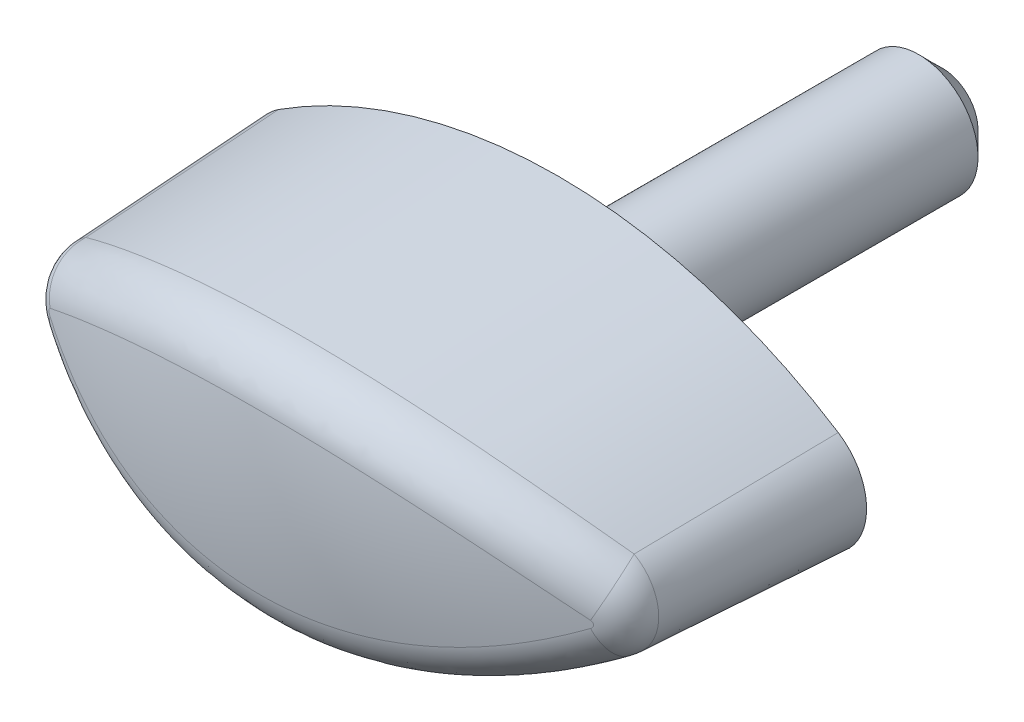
ISO-10303-21;
HEADER;
FILE_DESCRIPTION(('STEP AP214'),'2;1');
FILE_NAME('part.step','',(''),(''),'','','');
FILE_SCHEMA(('AUTOMOTIVE_DESIGN { 1 0 10303 214 1 1 1 1 }'));
ENDSEC;
DATA;
#1=APPLICATION_CONTEXT('core data for automotive mechanical design processes');
#2=APPLICATION_PROTOCOL_DEFINITION('international standard','automotive_design',2000,#1);
#3=PRODUCT_CONTEXT('',#1,'mechanical');
#4=PRODUCT('Part','Part','',(#3));
#5=PRODUCT_RELATED_PRODUCT_CATEGORY('part','',(#4));
#6=PRODUCT_DEFINITION_FORMATION('','',#4);
#7=PRODUCT_DEFINITION_CONTEXT('part definition',#1,'design');
#8=PRODUCT_DEFINITION('design','',#6,#7);
#9=PRODUCT_DEFINITION_SHAPE('','',#8);
#10=(LENGTH_UNIT() NAMED_UNIT(*) SI_UNIT(.MILLI.,.METRE.));
#11=(NAMED_UNIT(*) PLANE_ANGLE_UNIT() SI_UNIT($,.RADIAN.));
#12=(NAMED_UNIT(*) SI_UNIT($,.STERADIAN.) SOLID_ANGLE_UNIT());
#13=UNCERTAINTY_MEASURE_WITH_UNIT(LENGTH_MEASURE(1.E-05),#10,'distance_accuracy_value','');
#14=(GEOMETRIC_REPRESENTATION_CONTEXT(3) GLOBAL_UNCERTAINTY_ASSIGNED_CONTEXT((#13)) GLOBAL_UNIT_ASSIGNED_CONTEXT((#10,
#11,#12)) REPRESENTATION_CONTEXT('',''));
#15=CARTESIAN_POINT('',(0.,0.,0.));
#16=DIRECTION('',(0.,0.,1.));
#17=DIRECTION('',(1.,0.,0.));
#18=AXIS2_PLACEMENT_3D('',#15,#16,#17);
#19=CARTESIAN_POINT('',(0.,16.2061475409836,0.2));
#20=DIRECTION('',(0.,0.,-1.));
#21=DIRECTION('',(1.,0.,0.));
#22=AXIS2_PLACEMENT_3D('',#19,#20,#21);
#23=CONICAL_SURFACE('',#22,21.8561475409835,0.05235987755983);
#24=DIRECTION('',(0.0282659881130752,-0.044046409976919,-0.998629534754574));
#25=VECTOR('',#24,1.);
#26=CARTESIAN_POINT('',(11.8042271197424,-2.18818330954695,0.2));
#27=LINE('',#26,#25);
#28=CARTESIAN_POINT('',(11.5672178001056,-1.81885570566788,8.57347364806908));
#29=VERTEX_POINT('',#28);
#30=CARTESIAN_POINT('',(11.8042271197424,-2.18818330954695,0.2));
#31=VERTEX_POINT('',#30);
#32=EDGE_CURVE('E67',#29,#31,#27,.T.);
#33=ORIENTED_EDGE('',*,*,#32,.F.);
#34=CARTESIAN_POINT('',(16.4271005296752,4.04077128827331,6.40713273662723));
#35=CARTESIAN_POINT('',(17.0926019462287,3.05918648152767,6.02869797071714));
#36=CARTESIAN_POINT('',(16.6525406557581,2.44524763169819,5.03923403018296));
#37=CARTESIAN_POINT('',(16.2585809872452,3.85260775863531,6.59883012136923));
#38=CARTESIAN_POINT('',(16.926208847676,2.85960111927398,6.22100494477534));
#39=CARTESIAN_POINT('',(16.4824342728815,2.25390206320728,5.21559562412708));
#40=CARTESIAN_POINT('',(16.08502906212,3.66508667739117,6.78668348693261));
#41=CARTESIAN_POINT('',(16.7547344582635,2.66078768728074,6.40930934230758));
#42=CARTESIAN_POINT('',(16.3071905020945,2.06319388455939,5.38842072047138));
#43=CARTESIAN_POINT('',(15.7277470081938,3.29210943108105,7.15464886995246));
#44=CARTESIAN_POINT('',(16.4007505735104,2.26460172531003,6.77876476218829));
#45=CARTESIAN_POINT('',(15.9463115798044,1.68384716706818,5.7269488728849));
#46=CARTESIAN_POINT('',(15.5440159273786,3.10665346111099,7.33476016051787));
#47=CARTESIAN_POINT('',(16.218192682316,2.06723845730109,6.95988042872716));
#48=CARTESIAN_POINT('',(15.7606754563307,1.49520882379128,5.89265126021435));
#49=CARTESIAN_POINT('',(14.9771469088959,2.55432799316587,7.86361459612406));
#50=CARTESIAN_POINT('',(15.65212864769,1.4769888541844,7.49378323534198));
#51=CARTESIAN_POINT('',(15.1877641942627,0.933361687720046,6.37919734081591));
#52=CARTESIAN_POINT('',(14.5785877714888,2.19178794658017,8.20058814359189));
#53=CARTESIAN_POINT('',(15.2527614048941,1.08900357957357,7.83420074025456));
#54=CARTESIAN_POINT('',(14.784743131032,0.564512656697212,6.68921300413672));
#55=CARTESIAN_POINT('',(13.7396705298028,1.48408133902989,8.84285513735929));
#56=CARTESIAN_POINT('',(14.4076445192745,0.328451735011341,8.48548173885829));
#57=CARTESIAN_POINT('',(13.9360201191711,-0.155612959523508,7.28009863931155));
#58=CARTESIAN_POINT('',(13.299189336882,1.1389707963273,9.14804941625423));
#59=CARTESIAN_POINT('',(13.9614980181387,-0.0437819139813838,8.79586274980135));
#60=CARTESIAN_POINT('',(13.4901924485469,-0.506832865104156,7.56087737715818));
#61=CARTESIAN_POINT('',(12.3788396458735,0.474007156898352,9.72428583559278));
#62=CARTESIAN_POINT('',(13.0244079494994,-0.76414692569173,9.38421171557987));
#63=CARTESIAN_POINT('',(12.5582956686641,-1.18365619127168,8.09101488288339));
#64=CARTESIAN_POINT('',(11.8989905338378,0.154141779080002,9.99534462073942));
#65=CARTESIAN_POINT('',(12.5333362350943,-1.11189744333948,9.66176439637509));
#66=CARTESIAN_POINT('',(12.0722463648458,-1.50927206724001,8.34038896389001));
#67=CARTESIAN_POINT('',(10.9918679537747,-0.399283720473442,10.4564446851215));
#68=CARTESIAN_POINT('',(11.6009373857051,-1.71581007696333,10.1354756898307));
#69=CARTESIAN_POINT('',(11.1530988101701,-2.07271157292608,8.7646010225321));
#70=CARTESIAN_POINT('',(10.5706790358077,-0.638014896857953,10.6522866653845));
#71=CARTESIAN_POINT('',(11.1660220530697,-1.97724702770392,10.3372887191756));
#72=CARTESIAN_POINT('',(10.7262184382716,-2.31578759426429,8.94477564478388));
#73=CARTESIAN_POINT('',(9.70506863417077,-1.0909288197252,11.0194202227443));
#74=CARTESIAN_POINT('',(10.2686487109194,-2.47499013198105,10.7168267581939));
#75=CARTESIAN_POINT('',(9.84871220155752,-2.77698301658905,9.2825385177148));
#76=CARTESIAN_POINT('',(9.26065066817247,-1.30511526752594,11.1907155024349));
#77=CARTESIAN_POINT('',(9.80629346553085,-2.71099502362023,10.8942922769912));
#78=CARTESIAN_POINT('',(9.39808993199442,-2.99510618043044,9.44013017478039));
#79=CARTESIAN_POINT('',(8.35164218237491,-1.70545052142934,11.5077173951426));
#80=CARTESIAN_POINT('',(8.85709456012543,-3.15360413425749,11.2237259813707));
#81=CARTESIAN_POINT('',(8.47621761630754,-3.40282884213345,9.73177191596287));
#82=CARTESIAN_POINT('',(7.88709122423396,-1.89165136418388,11.6534715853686));
#83=CARTESIAN_POINT('',(8.37049092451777,-3.35994623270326,11.3754857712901));
#84=CARTESIAN_POINT('',(8.00500801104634,-3.59248127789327,9.86586577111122));
#85=CARTESIAN_POINT('',(6.93972810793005,-2.23368053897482,11.9190737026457));
#86=CARTESIAN_POINT('',(7.37482487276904,-3.74016648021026,11.6528309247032));
#87=CARTESIAN_POINT('',(7.04391934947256,-3.94087129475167,10.1102197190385));
#88=CARTESIAN_POINT('',(6.45691596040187,-2.38950888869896,12.0389216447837));
#89=CARTESIAN_POINT('',(6.86606148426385,-3.91373154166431,11.778175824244));
#90=CARTESIAN_POINT('',(6.55404030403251,-4.09960889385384,10.2204798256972));
#91=CARTESIAN_POINT('',(5.47422718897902,-2.66889743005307,12.2524891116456));
#92=CARTESIAN_POINT('',(5.82751619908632,-4.22580082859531,12.0021233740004));
#93=CARTESIAN_POINT('',(5.55684925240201,-4.38422670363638,10.4169618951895));
#94=CARTESIAN_POINT('',(4.97429072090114,-2.7923278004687,12.3461036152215));
#95=CARTESIAN_POINT('',(5.29806954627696,-4.36387330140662,12.1004035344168));
#96=CARTESIAN_POINT('',(5.04947605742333,-4.50997472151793,10.5030872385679));
#97=CARTESIAN_POINT('',(3.96272978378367,-3.00409931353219,12.5060314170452));
#98=CARTESIAN_POINT('',(4.2242075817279,-4.60133740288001,12.2686804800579));
#99=CARTESIAN_POINT('',(4.02277805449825,-4.72572979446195,10.6502208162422));
#100=CARTESIAN_POINT('',(3.45110519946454,-3.0924401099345,12.5723444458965));
#101=CARTESIAN_POINT('',(3.68028447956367,-4.70049066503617,12.3385056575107));
#102=CARTESIAN_POINT('',(3.50345312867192,-4.8157364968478,10.7112288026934));
#103=CARTESIAN_POINT('',(2.41973997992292,-3.23260047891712,12.6772955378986));
#104=CARTESIAN_POINT('',(2.5818111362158,-4.85810549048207,12.4492154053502));
#105=CARTESIAN_POINT('',(2.45650599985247,-4.95854272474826,10.8077838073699));
#106=CARTESIAN_POINT('',(1.89999456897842,-3.28439766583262,12.7159166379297));
#107=CARTESIAN_POINT('',(2.02781849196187,-4.91637456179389,12.4899638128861));
#108=CARTESIAN_POINT('',(1.92887891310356,-5.011319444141,10.8433152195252));
#109=CARTESIAN_POINT('',(0.856813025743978,-3.35050150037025,12.7651719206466));
#110=CARTESIAN_POINT('',(0.91460255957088,-4.99083732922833,12.5420003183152));
#111=CARTESIAN_POINT('',(0.869850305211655,-5.07867371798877,10.8886300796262));
#112=CARTESIAN_POINT('',(0.333377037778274,-3.36480960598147,12.7758071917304));
#113=CARTESIAN_POINT('',(0.355986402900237,-5.00695089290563,12.5532323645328));
#114=CARTESIAN_POINT('',(0.338448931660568,-5.09325275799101,10.898414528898));
#115=CARTESIAN_POINT('',(-0.687903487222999,-3.35591787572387,12.769190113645));
#116=CARTESIAN_POINT('',(-0.734449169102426,-4.99692946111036,12.5462382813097));
#117=CARTESIAN_POINT('',(-0.698369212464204,-5.08419274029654,10.8923268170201));
#118=CARTESIAN_POINT('',(-1.18577326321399,-3.33448127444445,12.7532487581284));
#119=CARTESIAN_POINT('',(-1.26571963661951,-4.97279015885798,12.529403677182));
#120=CARTESIAN_POINT('',(-1.20381178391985,-5.06235030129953,10.877660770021));
#121=CARTESIAN_POINT('',(-2.17741077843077,-3.25774611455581,12.6960336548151));
#122=CARTESIAN_POINT('',(-2.32364698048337,-4.88637248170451,12.4689708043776));
#123=CARTESIAN_POINT('',(-2.21050207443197,-4.98416400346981,10.8250228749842));
#124=CARTESIAN_POINT('',(-2.67117868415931,-3.20244893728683,12.6547609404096));
#125=CARTESIAN_POINT('',(-2.84978564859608,-4.82418127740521,12.4254336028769));
#126=CARTESIAN_POINT('',(-2.71174996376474,-4.92782155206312,10.7870519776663));
#127=CARTESIAN_POINT('',(-3.65072386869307,-3.05889693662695,12.5471607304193));
#128=CARTESIAN_POINT('',(-3.89265326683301,-4.66280856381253,12.3119643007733));
#129=CARTESIAN_POINT('',(-3.70607731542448,-4.78156081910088,10.6880597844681));
#130=CARTESIAN_POINT('',(-4.13650708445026,-2.97066787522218,12.4808528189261));
#131=CARTESIAN_POINT('',(-4.40891081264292,-4.56381017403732,12.2421620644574));
#132=CARTESIAN_POINT('',(-4.19916284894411,-4.69166878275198,10.627056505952));
#133=CARTESIAN_POINT('',(-5.09717290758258,-2.76257685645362,12.3235430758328));
#134=CARTESIAN_POINT('',(-5.42834711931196,-4.33055204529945,12.076689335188));
#135=CARTESIAN_POINT('',(-5.17418741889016,-4.47966509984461,10.4823315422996));
#136=CARTESIAN_POINT('',(-5.57205517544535,-2.64271391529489,12.23254047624));
#137=CARTESIAN_POINT('',(-5.93110791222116,-4.19650152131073,11.9811697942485));
#138=CARTESIAN_POINT('',(-5.65612610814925,-4.35755245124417,10.39860915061));
#139=CARTESIAN_POINT('',(-6.52342620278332,-2.36863314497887,12.0228841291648));
#140=CARTESIAN_POINT('',(-6.93622900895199,-3.89045001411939,11.7613818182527));
#141=CARTESIAN_POINT('',(-6.62152588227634,-4.07834322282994,10.2057253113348));
#142=CARTESIAN_POINT('',(-6.99944348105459,-2.21340563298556,11.9034116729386));
#143=CARTESIAN_POINT('',(-7.43771431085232,-3.71758760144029,11.6364504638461));
#144=CARTESIAN_POINT('',(-7.1045048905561,-3.92021853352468,10.0958106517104));
#145=CARTESIAN_POINT('',(-7.93357302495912,-1.87343069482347,11.6392301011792));
#146=CARTESIAN_POINT('',(-8.4192497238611,-3.33972387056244,11.3606353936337));
#147=CARTESIAN_POINT('',(-8.05215764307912,-3.57392264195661,9.85276360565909));
#148=CARTESIAN_POINT('',(-8.39168486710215,-1.68868257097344,11.4945203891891));
#149=CARTESIAN_POINT('',(-8.89901518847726,-3.13502380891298,11.2099834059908));
#150=CARTESIAN_POINT('',(-8.51683095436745,-3.38575072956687,9.71963067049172));
#151=CARTESIAN_POINT('',(-9.28832878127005,-1.29198854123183,11.1802342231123));
#152=CARTESIAN_POINT('',(-9.83514248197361,-2.69650353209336,10.8834130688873));
#153=CARTESIAN_POINT('',(-9.4261554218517,-2.981738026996,9.43048739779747));
#154=CARTESIAN_POINT('',(-9.72681941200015,-1.07998842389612,11.010608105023));
#155=CARTESIAN_POINT('',(-10.2912719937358,-2.46293111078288,10.7076916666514));
#156=CARTESIAN_POINT('',(-9.87076421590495,-2.76584208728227,9.27443136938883));
#157=CARTESIAN_POINT('',(-10.5811244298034,-0.63209213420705,10.647427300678));
#158=CARTESIAN_POINT('',(-11.1768417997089,-1.9707403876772,10.3322652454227));
#159=CARTESIAN_POINT('',(-10.7368049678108,-2.30975704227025,8.94030502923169));
#160=CARTESIAN_POINT('',(-10.9969353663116,-0.396192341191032,10.4538689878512));
#161=CARTESIAN_POINT('',(-11.6061841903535,-1.71241191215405,10.1328101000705));
#162=CARTESIAN_POINT('',(-11.1582333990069,-2.06956425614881,8.76223138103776));
#163=CARTESIAN_POINT('',(-11.8989748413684,0.154132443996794,9.99535244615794));
#164=CARTESIAN_POINT('',(-12.5333203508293,-1.11190751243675,9.66177236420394));
#165=CARTESIAN_POINT('',(-12.0722304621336,-1.50928157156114,8.34039616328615));
#166=CARTESIAN_POINT('',(-12.3788134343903,0.473989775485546,9.72430057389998));
#167=CARTESIAN_POINT('',(-13.0243812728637,-0.764165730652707,9.38422673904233));
#168=CARTESIAN_POINT('',(-12.5582691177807,-1.18367388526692,8.0910284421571));
#169=CARTESIAN_POINT('',(-13.2991488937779,1.13894001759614,9.14807641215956));
#170=CARTESIAN_POINT('',(-13.9614569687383,-0.0438151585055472,8.79589023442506));
#171=CARTESIAN_POINT('',(-13.490151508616,-0.50686419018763,7.56090221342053));
#172=CARTESIAN_POINT('',(-13.7396257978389,1.48404557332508,8.84288698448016));
#173=CARTESIAN_POINT('',(-14.4075993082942,0.328413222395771,8.48551407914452));
#174=CARTESIAN_POINT('',(-13.935974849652,-0.15564935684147,7.2801279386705));
#175=CARTESIAN_POINT('',(-14.5785517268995,2.19175557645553,8.20061812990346));
#176=CARTESIAN_POINT('',(-15.2527251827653,1.08896883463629,7.83423112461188));
#177=CARTESIAN_POINT('',(-14.7847066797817,0.564479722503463,6.68924059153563));
#178=CARTESIAN_POINT('',(-14.9771223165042,2.55430469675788,7.86363664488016));
#179=CARTESIAN_POINT('',(-15.6521040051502,1.47696388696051,7.49380555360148));
#180=CARTESIAN_POINT('',(-15.1877393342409,0.933337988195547,6.37921762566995));
#181=CARTESIAN_POINT('',(-15.5440042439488,3.10664174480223,7.33477150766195));
#182=CARTESIAN_POINT('',(-16.2181810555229,2.06722597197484,6.95989185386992));
#183=CARTESIAN_POINT('',(-15.7606636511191,1.49519690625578,5.89266169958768));
#184=CARTESIAN_POINT('',(-15.7277377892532,3.29209996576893,7.15465813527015));
#185=CARTESIAN_POINT('',(-16.4007414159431,2.26459165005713,6.7787740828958));
#186=CARTESIAN_POINT('',(-15.9463022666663,1.68383753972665,5.72695739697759));
#187=CARTESIAN_POINT('',(-16.085024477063,3.66508173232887,6.78668843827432));
#188=CARTESIAN_POINT('',(-16.7547299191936,2.66078243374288,6.40931431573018));
#189=CARTESIAN_POINT('',(-16.3071858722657,2.06318885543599,5.38842527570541));
#190=CARTESIAN_POINT('',(-16.2585785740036,3.85260508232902,6.59883284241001));
#191=CARTESIAN_POINT('',(-16.9262064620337,2.85959827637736,6.22100767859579));
#192=CARTESIAN_POINT('',(-16.4824318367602,2.25389934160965,5.21559812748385));
#193=CARTESIAN_POINT('',(-16.4271001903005,4.04077090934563,6.40713312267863));
#194=CARTESIAN_POINT('',(-17.0926016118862,3.05918608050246,6.02869835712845));
#195=CARTESIAN_POINT('',(-16.6525403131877,2.44524724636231,5.03923438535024));
#196=(BOUNDED_SURFACE() B_SPLINE_SURFACE(3,2,((#34,#35,#36),(#37,#38,#39),(#40,#41,#42),(#43,
#44,#45),(#46,#47,#48),(#49,#50,#51),(#52,#53,#54),(#55,#56,#57),(#58,#59,#60),(#61,#62,#63),
(#64,#65,#66),(#67,#68,#69),(#70,#71,#72),(#73,#74,#75),(#76,#77,#78),(#79,#80,#81),(#82,#83,
#84),(#85,#86,#87),(#88,#89,#90),(#91,#92,#93),(#94,#95,#96),(#97,#98,#99),(#100,#101,#102),
(#103,#104,#105),(#106,#107,#108),(#109,#110,#111),(#112,#113,#114),(#115,#116,#117),(#118,#119,
#120),(#121,#122,#123),(#124,#125,#126),(#127,#128,#129),(#130,#131,#132),(#133,#134,#135),
(#136,#137,#138),(#139,#140,#141),(#142,#143,#144),(#145,#146,#147),(#148,#149,#150),(#151,#152,
#153),(#154,#155,#156),(#157,#158,#159),(#160,#161,#162),(#163,#164,#165),(#166,#167,#168),
(#169,#170,#171),(#172,#173,#174),(#175,#176,#177),(#178,#179,#180),(#181,#182,#183),(#184,#185,
#186),(#187,#188,#189),(#190,#191,#192),(#193,#194,#195)),.UNSPECIFIED.,.F.,.F.,
.F.) B_SPLINE_SURFACE_WITH_KNOTS((4,2,2,2,2,2,2,2,2,2,2,2,2,2,2,2,2,2,2,2,2,2,2,2,2,2,4),(3,3),
(0.,0.875075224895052,1.7502324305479,3.50187037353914,5.25882008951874,7.01490975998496,
8.45488787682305,9.89464856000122,11.33169810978,12.7687468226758,14.2114689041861,
15.6542052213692,17.097824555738,18.5413877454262,19.9158269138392,21.2902100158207,
22.6635202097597,24.0368731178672,25.4558847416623,26.8749299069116,28.2968429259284,
29.7189716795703,31.4750152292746,33.2319443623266,34.9836274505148,35.858795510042,
36.7338813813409),(0.,1.),
.UNSPECIFIED.) GEOMETRIC_REPRESENTATION_ITEM() RATIONAL_B_SPLINE_SURFACE(((1.,0.848982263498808,
1.),(1.,0.84709050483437,1.),(1.,0.845197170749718,1.),(1.,0.841415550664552,1.),(1.,
0.839527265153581,1.),(1.,0.833879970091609,1.),(1.,0.830141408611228,1.),(1.,0.82278429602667,
1.),(1.,0.819166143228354,1.),(1.,0.812141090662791,1.),(1.,0.80873408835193,1.),(1.,
0.802797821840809,1.),(1.,0.800220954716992,1.),(1.,0.795306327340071,1.),(1.,0.792968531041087,
1.),(1.,0.788578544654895,1.),(1.,0.786525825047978,1.),(1.,0.782740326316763,1.),(1.,
0.781007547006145,1.),(1.,0.777891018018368,1.),(1.,0.776508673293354,1.),(1.,0.774131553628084,
1.),(1.,0.773136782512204,1.),(1.,0.77155636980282,1.),(1.,0.770970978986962,1.),(1.,
0.770223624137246,1.),(1.,0.770061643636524,1.),(1.,0.770162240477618,1.),(1.,0.770404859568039,
1.),(1.,0.771272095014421,1.),(1.,0.771896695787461,1.),(1.,0.773514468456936,1.),(1.,
0.774507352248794,1.),(1.,0.77684190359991,1.),(1.,0.778183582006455,1.),(1.,0.781239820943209,
1.),(1.,0.782965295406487,1.),(1.,0.786726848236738,1.),(1.,0.788762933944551,1.),(1.,
0.793111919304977,1.),(1.,0.79542537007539,1.),(1.,0.800284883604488,1.),(1.,0.802830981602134,
1.),(1.,0.808733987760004,1.),(1.,0.812140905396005,1.),(1.,0.819165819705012,1.),(1.,
0.822783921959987,1.),(1.,0.830141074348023,1.),(1.,0.83387973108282,1.),(1.,0.839527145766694,
1.),(1.,0.841415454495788,1.),(1.,0.845197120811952,1.),(1.,0.847090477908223,1.),(1.,
0.848982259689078,1.))) REPRESENTATION_ITEM('') SURFACE());
#197=CARTESIAN_POINT('',(16.6525406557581,2.44524763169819,5.03923403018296));
#198=CARTESIAN_POINT('',(16.4824342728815,2.25390206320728,5.21559562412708));
#199=CARTESIAN_POINT('',(16.3071905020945,2.06319388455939,5.38842072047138));
#200=CARTESIAN_POINT('',(15.9463115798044,1.68384716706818,5.7269488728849));
#201=CARTESIAN_POINT('',(15.7606754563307,1.49520882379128,5.89265126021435));
#202=CARTESIAN_POINT('',(15.1877641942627,0.933361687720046,6.37919734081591));
#203=CARTESIAN_POINT('',(14.784743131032,0.564512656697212,6.68921300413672));
#204=CARTESIAN_POINT('',(13.9360201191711,-0.155612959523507,7.28009863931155));
#205=CARTESIAN_POINT('',(13.4901924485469,-0.506832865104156,7.56087737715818));
#206=CARTESIAN_POINT('',(12.5582956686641,-1.18365619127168,8.09101488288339));
#207=CARTESIAN_POINT('',(12.0722463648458,-1.50927206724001,8.34038896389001));
#208=CARTESIAN_POINT('',(11.1530988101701,-2.07271157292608,8.7646010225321));
#209=CARTESIAN_POINT('',(10.7262184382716,-2.31578759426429,8.94477564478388));
#210=CARTESIAN_POINT('',(9.84871220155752,-2.77698301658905,9.2825385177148));
#211=CARTESIAN_POINT('',(9.39808993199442,-2.99510618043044,9.44013017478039));
#212=CARTESIAN_POINT('',(8.47621761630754,-3.40282884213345,9.73177191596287));
#213=CARTESIAN_POINT('',(8.00500801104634,-3.59248127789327,9.86586577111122));
#214=CARTESIAN_POINT('',(7.04391934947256,-3.94087129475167,10.1102197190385));
#215=CARTESIAN_POINT('',(6.55404030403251,-4.09960889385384,10.2204798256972));
#216=CARTESIAN_POINT('',(5.55684925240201,-4.38422670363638,10.4169618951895));
#217=CARTESIAN_POINT('',(5.04947605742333,-4.50997472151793,10.5030872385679));
#218=CARTESIAN_POINT('',(4.02277805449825,-4.72572979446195,10.6502208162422));
#219=CARTESIAN_POINT('',(3.50345312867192,-4.8157364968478,10.7112288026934));
#220=CARTESIAN_POINT('',(2.45650599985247,-4.95854272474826,10.8077838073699));
#221=CARTESIAN_POINT('',(1.92887891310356,-5.011319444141,10.8433152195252));
#222=CARTESIAN_POINT('',(0.869850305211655,-5.07867371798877,10.8886300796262));
#223=CARTESIAN_POINT('',(0.33844893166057,-5.09325275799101,10.898414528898));
#224=CARTESIAN_POINT('',(-0.698369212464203,-5.08419274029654,10.8923268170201));
#225=CARTESIAN_POINT('',(-1.20381178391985,-5.06235030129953,10.877660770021));
#226=CARTESIAN_POINT('',(-2.21050207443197,-4.98416400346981,10.8250228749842));
#227=CARTESIAN_POINT('',(-2.71174996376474,-4.92782155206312,10.7870519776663));
#228=CARTESIAN_POINT('',(-3.70607731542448,-4.78156081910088,10.6880597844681));
#229=CARTESIAN_POINT('',(-4.19916284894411,-4.69166878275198,10.627056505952));
#230=CARTESIAN_POINT('',(-5.17418741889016,-4.47966509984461,10.4823315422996));
#231=CARTESIAN_POINT('',(-5.65612610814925,-4.35755245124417,10.39860915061));
#232=CARTESIAN_POINT('',(-6.62152588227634,-4.07834322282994,10.2057253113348));
#233=CARTESIAN_POINT('',(-7.1045048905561,-3.92021853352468,10.0958106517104));
#234=CARTESIAN_POINT('',(-8.05215764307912,-3.57392264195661,9.85276360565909));
#235=CARTESIAN_POINT('',(-8.51683095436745,-3.38575072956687,9.71963067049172));
#236=CARTESIAN_POINT('',(-9.4261554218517,-2.981738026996,9.43048739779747));
#237=CARTESIAN_POINT('',(-9.87076421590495,-2.76584208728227,9.27443136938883));
#238=CARTESIAN_POINT('',(-10.7368049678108,-2.30975704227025,8.94030502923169));
#239=CARTESIAN_POINT('',(-11.1582333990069,-2.06956425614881,8.76223138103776));
#240=CARTESIAN_POINT('',(-12.0722304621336,-1.50928157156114,8.34039616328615));
#241=CARTESIAN_POINT('',(-12.5582691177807,-1.18367388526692,8.0910284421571));
#242=CARTESIAN_POINT('',(-13.490151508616,-0.50686419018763,7.56090221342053));
#243=CARTESIAN_POINT('',(-13.935974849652,-0.15564935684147,7.2801279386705));
#244=CARTESIAN_POINT('',(-14.7847066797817,0.564479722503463,6.68924059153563));
#245=CARTESIAN_POINT('',(-15.1877393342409,0.933337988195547,6.37921762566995));
#246=CARTESIAN_POINT('',(-15.7606636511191,1.49519690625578,5.89266169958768));
#247=CARTESIAN_POINT('',(-15.9463022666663,1.68383753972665,5.72695739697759));
#248=CARTESIAN_POINT('',(-16.3071858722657,2.06318885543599,5.38842527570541));
#249=CARTESIAN_POINT('',(-16.4824318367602,2.25389934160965,5.21559812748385));
#250=CARTESIAN_POINT('',(-16.6525403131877,2.44524724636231,5.03923438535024));
#251=B_SPLINE_CURVE_WITH_KNOTS('',3,(#197,#198,#199,#200,#201,#202,#203,#204,#205,#206,#207,
#208,#209,#210,#211,#212,#213,#214,#215,#216,#217,#218,#219,#220,#221,#222,#223,#224,#225,#226,
#227,#228,#229,#230,#231,#232,#233,#234,#235,#236,#237,#238,#239,#240,#241,#242,#243,#244,#245,
#246,#247,#248,#249,#250),.UNSPECIFIED.,.F.,.F.,(4,2,2,2,2,2,2,2,2,2,2,2,2,2,2,2,2,2,2,2,2,2,2,
2,2,2,4),(0.,0.875075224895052,1.7502324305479,3.50187037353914,5.25882008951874,
7.01490975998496,8.45488787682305,9.89464856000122,11.33169810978,12.7687468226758,
14.2114689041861,15.6542052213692,17.097824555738,18.5413877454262,19.9158269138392,
21.2902100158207,22.6635202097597,24.0368731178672,25.4558847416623,26.8749299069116,
28.2968429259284,29.7189716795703,31.4750152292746,33.2319443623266,34.9836274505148,
35.858795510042,36.7338813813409),.UNSPECIFIED.);
#252=CARTESIAN_POINT('',(-11.5672173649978,-1.81885597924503,8.57347373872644));
#253=VERTEX_POINT('',#252);
#254=EDGE_CURVE('E30',#29,#253,#251,.T.);
#255=ORIENTED_EDGE('',*,*,#254,.T.);
#256=DIRECTION('',(-0.0282659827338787,-0.0440464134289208,-0.998629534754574));
#257=VECTOR('',#256,1.);
#258=CARTESIAN_POINT('',(-11.8042266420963,-2.18818361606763,0.2));
#259=LINE('',#258,#257);
#260=CARTESIAN_POINT('',(-11.8042266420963,-2.18818361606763,0.2));
#261=VERTEX_POINT('',#260);
#262=EDGE_CURVE('E85',#253,#261,#259,.T.);
#263=ORIENTED_EDGE('',*,*,#262,.T.);
#264=CARTESIAN_POINT('',(0.,16.2061475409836,0.2));
#265=DIRECTION('',(0.,0.,1.));
#266=DIRECTION('',(1.,0.,0.));
#267=AXIS2_PLACEMENT_3D('',#264,#265,#266);
#268=CIRCLE('',#267,21.8561475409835);
#269=EDGE_CURVE('E81',#261,#31,#268,.T.);
#270=ORIENTED_EDGE('',*,*,#269,.T.);
#271=EDGE_LOOP('',(#33,#255,#263,#270));
#272=FACE_BOUND('',#271,.T.);
#273=ADVANCED_FACE('F14',(#272),#23,.T.);
#274=CARTESIAN_POINT('',(10.4,0.,0.2));
#275=DIRECTION('',(0.,0.,-1.));
#276=DIRECTION('',(1.,0.,0.));
#277=AXIS2_PLACEMENT_3D('',#274,#275,#276);
#278=CONICAL_SURFACE('',#277,2.6,0.05235987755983);
#279=DIRECTION('',(0.0282659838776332,0.0440464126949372,-0.998629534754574));
#280=VECTOR('',#279,1.);
#281=CARTESIAN_POINT('',(11.8042271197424,2.18818330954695,0.2));
#282=LINE('',#281,#280);
#283=CARTESIAN_POINT('',(11.5672178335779,1.81885567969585,8.57347372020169));
#284=VERTEX_POINT('',#283);
#285=CARTESIAN_POINT('',(11.8042271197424,2.18818330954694,0.2));
#286=VERTEX_POINT('',#285);
#287=EDGE_CURVE('E74',#284,#286,#282,.T.);
#288=ORIENTED_EDGE('',*,*,#287,.F.);
#289=CARTESIAN_POINT('',(11.3400690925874,0.172896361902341,10.2794286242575));
#290=CARTESIAN_POINT('',(11.5780599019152,1.87931271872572,10.1450506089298));
#291=CARTESIAN_POINT('',(10.8369727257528,2.11501444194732,8.60174624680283));
#292=CARTESIAN_POINT('',(11.3506112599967,0.17101013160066,10.2740774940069));
#293=CARTESIAN_POINT('',(11.6642783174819,1.81641301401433,10.1016539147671));
#294=CARTESIAN_POINT('',(10.9653127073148,2.08881990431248,8.59682320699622));
#295=CARTESIAN_POINT('',(11.3610262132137,0.168141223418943,10.2687888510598));
#296=CARTESIAN_POINT('',(11.744830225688,1.74757226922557,10.0611041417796));
#297=CARTESIAN_POINT('',(11.0914965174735,2.05078298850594,8.59195765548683));
#298=CARTESIAN_POINT('',(11.3813028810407,0.160477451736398,10.2584890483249));
#299=CARTESIAN_POINT('',(11.8928044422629,1.60137455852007,9.98660547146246));
#300=CARTESIAN_POINT('',(11.3361678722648,1.95181480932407,8.58248183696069));
#301=CARTESIAN_POINT('',(11.3911631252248,0.155677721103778,10.2534786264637));
#302=CARTESIAN_POINT('',(11.9606185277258,1.52401777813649,9.95245949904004));
#303=CARTESIAN_POINT('',(11.4546350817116,1.89082571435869,8.57787224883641));
#304=CARTESIAN_POINT('',(11.4088520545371,0.144886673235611,10.2444872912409));
#305=CARTESIAN_POINT('',(12.0764993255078,1.37214420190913,9.89410390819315));
#306=CARTESIAN_POINT('',(11.6663621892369,1.7554763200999,8.56960022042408));
#307=CARTESIAN_POINT('',(11.4167827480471,0.139105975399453,10.2404548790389));
#308=CARTESIAN_POINT('',(12.1261163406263,1.29848252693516,9.86911459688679));
#309=CARTESIAN_POINT('',(11.7609430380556,1.68358103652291,8.56589040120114));
#310=CARTESIAN_POINT('',(11.4316870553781,0.126168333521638,10.2328748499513));
#311=CARTESIAN_POINT('',(12.2159872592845,1.14686018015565,9.82384714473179));
#312=CARTESIAN_POINT('',(11.9381750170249,1.52386035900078,8.55891677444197));
#313=CARTESIAN_POINT('',(11.4386617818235,0.119013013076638,10.2293266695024));
#314=CARTESIAN_POINT('',(12.2564694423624,1.06880763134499,9.80345409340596));
#315=CARTESIAN_POINT('',(12.0208400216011,1.43605376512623,8.55565244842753));
#316=CARTESIAN_POINT('',(11.4514345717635,0.103406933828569,10.2228275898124));
#317=CARTESIAN_POINT('',(12.3284346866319,0.908629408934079,9.76719813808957));
#318=CARTESIAN_POINT('',(12.1718602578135,1.24554657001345,8.54967329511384));
#319=CARTESIAN_POINT('',(11.4572262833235,0.0949495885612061,10.2198799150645));
#320=CARTESIAN_POINT('',(12.3600595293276,0.826331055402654,9.75126382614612));
#321=CARTESIAN_POINT('',(12.2401383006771,1.14277039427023,8.54696143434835));
#322=CARTESIAN_POINT('',(11.4673165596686,0.0769732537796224,10.2147437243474));
#323=CARTESIAN_POINT('',(12.4139453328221,0.65881478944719,9.72411135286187));
#324=CARTESIAN_POINT('',(12.3588786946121,0.925121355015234,8.5422361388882));
#325=CARTESIAN_POINT('',(11.4716155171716,0.0674545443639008,10.2125550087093));
#326=CARTESIAN_POINT('',(12.436359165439,0.573401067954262,9.7128161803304));
#327=CARTESIAN_POINT('',(12.4093457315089,0.810251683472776,8.54022252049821));
#328=CARTESIAN_POINT('',(11.4781806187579,0.0485336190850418,10.2092122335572));
#329=CARTESIAN_POINT('',(12.4701103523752,0.408222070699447,9.69580694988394));
#330=CARTESIAN_POINT('',(12.4863326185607,0.582446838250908,8.5371471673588));
#331=CARTESIAN_POINT('',(11.480592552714,0.0391951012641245,10.2079839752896));
#332=CARTESIAN_POINT('',(12.4823261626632,0.328469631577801,9.68965027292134));
#333=CARTESIAN_POINT('',(12.514571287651,0.470233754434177,8.53601716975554));
#334=CARTESIAN_POINT('',(11.4838532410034,0.0201820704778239,10.2063234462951));
#335=CARTESIAN_POINT('',(12.4987378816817,0.168216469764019,9.68137876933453));
#336=CARTESIAN_POINT('',(12.5527336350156,0.242009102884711,8.53448948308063));
#337=CARTESIAN_POINT('',(11.4847029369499,0.010507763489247,10.205890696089));
#338=CARTESIAN_POINT('',(12.5029806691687,0.087514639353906,9.679240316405));
#339=CARTESIAN_POINT('',(12.5626683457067,0.125999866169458,8.53409135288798));
#340=CARTESIAN_POINT('',(11.4847915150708,-0.00810013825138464,10.205845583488));
#341=CARTESIAN_POINT('',(12.5034227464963,-0.0674578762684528,9.67901750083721));
#342=CARTESIAN_POINT('',(12.5637040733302,-0.0971297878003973,8.53404984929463));
#343=CARTESIAN_POINT('',(11.4841496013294,-0.0170333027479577,10.2061725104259));
#344=CARTESIAN_POINT('',(12.5002185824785,-0.141915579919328,9.6806324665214));
#345=CARTESIAN_POINT('',(12.5561988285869,-0.204245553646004,8.53435062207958));
#346=CARTESIAN_POINT('',(11.4815287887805,-0.0346471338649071,10.2075071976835));
#347=CARTESIAN_POINT('',(12.4870513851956,-0.289940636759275,9.68726877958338));
#348=CARTESIAN_POINT('',(12.5255307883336,-0.415620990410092,8.53557853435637));
#349=CARTESIAN_POINT('',(11.479550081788,-0.0433278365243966,10.2085148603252));
#350=CARTESIAN_POINT('',(12.4770605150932,-0.363667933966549,9.69230415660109));
#351=CARTESIAN_POINT('',(12.5023702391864,-0.519881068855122,8.5365055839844));
#352=CARTESIAN_POINT('',(11.4743596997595,-0.0601529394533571,10.2111577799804));
#353=CARTESIAN_POINT('',(12.4505320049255,-0.509143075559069,9.70567373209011));
#354=CARTESIAN_POINT('',(12.441535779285,-0.722288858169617,8.53893707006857));
#355=CARTESIAN_POINT('',(11.4711551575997,-0.0683001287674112,10.2127894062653));
#356=CARTESIAN_POINT('',(12.4339763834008,-0.581045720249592,9.71401699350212));
#357=CARTESIAN_POINT('',(12.4039458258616,-0.820468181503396,8.54043816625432));
#358=CARTESIAN_POINT('',(11.4636400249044,-0.0839260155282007,10.2166152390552));
#359=CARTESIAN_POINT('',(12.3944606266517,-0.722801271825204,9.7339296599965));
#360=CARTESIAN_POINT('',(12.3156335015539,-1.0092261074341,8.54395793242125));
#361=CARTESIAN_POINT('',(11.4593288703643,-0.0914043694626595,10.218809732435));
#362=CARTESIAN_POINT('',(12.3714183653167,-0.792777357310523,9.74554044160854));
#363=CARTESIAN_POINT('',(12.264904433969,-1.09980080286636,8.54597686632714));
#364=CARTESIAN_POINT('',(11.4494533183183,-0.10598631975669,10.2238357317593));
#365=CARTESIAN_POINT('',(12.3173986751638,-0.934535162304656,9.7727581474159));
#366=CARTESIAN_POINT('',(12.1484446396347,-1.27698499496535,8.55060078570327));
#367=CARTESIAN_POINT('',(11.4438274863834,-0.113037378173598,10.2266984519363));
#368=CARTESIAN_POINT('',(12.2859148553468,-1.00623713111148,9.78862006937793));
#369=CARTESIAN_POINT('',(12.0819751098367,-1.3629939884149,8.55323448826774));
#370=CARTESIAN_POINT('',(11.4316934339,-0.126091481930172,10.2328714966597));
#371=CARTESIAN_POINT('',(12.2159340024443,-1.14627092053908,9.82387369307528));
#372=CARTESIAN_POINT('',(11.9382199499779,-1.52294548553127,8.5589136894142));
#373=CARTESIAN_POINT('',(11.4251859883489,-0.132095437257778,10.2361814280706));
#374=CARTESIAN_POINT('',(12.177302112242,-1.21469831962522,9.84333329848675));
#375=CARTESIAN_POINT('',(11.8609438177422,-1.59689846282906,8.56195882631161));
#376=CARTESIAN_POINT('',(11.4126351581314,-0.142063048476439,10.2425636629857));
#377=CARTESIAN_POINT('',(12.1001829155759,-1.33635978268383,9.88217559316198));
#378=CARTESIAN_POINT('',(11.711455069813,-1.72039374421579,8.56783048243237));
#379=CARTESIAN_POINT('',(11.4066996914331,-0.146200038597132,10.2455813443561));
#380=CARTESIAN_POINT('',(12.0626089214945,-1.39035123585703,9.90109887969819));
#381=CARTESIAN_POINT('',(11.6405996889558,-1.77194911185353,8.57060674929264));
#382=CARTESIAN_POINT('',(11.3912079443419,-0.155649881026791,10.253455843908));
#383=CARTESIAN_POINT('',(11.9609169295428,-1.52362321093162,9.95230922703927));
#384=CARTESIAN_POINT('',(11.45517132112,-1.8904771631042,8.57785128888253));
#385=CARTESIAN_POINT('',(11.3813916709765,-0.160433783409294,10.2584439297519));
#386=CARTESIAN_POINT('',(11.8934207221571,-1.60066776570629,9.98629515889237));
#387=CARTESIAN_POINT('',(11.3372345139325,-1.95126041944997,8.58244032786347));
#388=CARTESIAN_POINT('',(11.3611169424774,-0.168117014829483,10.2687427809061));
#389=CARTESIAN_POINT('',(11.7455251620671,-1.74698463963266,10.0607543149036));
#390=CARTESIAN_POINT('',(11.0925961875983,-2.05046075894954,8.59191527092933));
#391=CARTESIAN_POINT('',(11.3506548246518,-0.17100425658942,10.2740553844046));
#392=CARTESIAN_POINT('',(11.6646334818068,-1.81617039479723,10.1014751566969));
#393=CARTESIAN_POINT('',(10.9658440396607,-2.08873423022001,8.59680286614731));
#394=CARTESIAN_POINT('',(11.3400690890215,-0.172896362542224,10.2794286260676));
#395=CARTESIAN_POINT('',(11.5780598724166,-1.87931274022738,10.1450506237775));
#396=CARTESIAN_POINT('',(10.8369726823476,-2.11501445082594,8.60174624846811));
#397=(BOUNDED_SURFACE() B_SPLINE_SURFACE(3,2,((#289,#290,#291),(#292,#293,#294),(#295,#296,
#297),(#298,#299,#300),(#301,#302,#303),(#304,#305,#306),(#307,#308,#309),(#310,#311,#312),
(#313,#314,#315),(#316,#317,#318),(#319,#320,#321),(#322,#323,#324),(#325,#326,#327),(#328,#329,
#330),(#331,#332,#333),(#334,#335,#336),(#337,#338,#339),(#340,#341,#342),(#343,#344,#345),
(#346,#347,#348),(#349,#350,#351),(#352,#353,#354),(#355,#356,#357),(#358,#359,#360),(#361,#362,
#363),(#364,#365,#366),(#367,#368,#369),(#370,#371,#372),(#373,#374,#375),(#376,#377,#378),
(#379,#380,#381),(#382,#383,#384),(#385,#386,#387),(#388,#389,#390),(#391,#392,#393),(#394,#395,
#396)),.UNSPECIFIED.,.F.,.F.,.F.) B_SPLINE_SURFACE_WITH_KNOTS((4,2,2,2,2,2,2,2,2,2,2,2,2,2,2,2,
2,4),(3,3),(0.,0.0330290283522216,0.0661418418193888,0.0953021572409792,0.124428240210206,
0.153706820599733,0.182977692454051,0.209668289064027,0.236342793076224,0.260959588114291,
0.285572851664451,0.310045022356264,0.334529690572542,0.360542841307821,0.386533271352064,
0.408124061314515,0.441090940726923,0.474265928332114),(0.,1.),
.UNSPECIFIED.) GEOMETRIC_REPRESENTATION_ITEM() RATIONAL_B_SPLINE_SURFACE(((1.,0.756656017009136,
1.),(1.,0.765521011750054,1.),(1.,0.7740726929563,1.),(1.,0.790402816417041,1.),(1.,
0.798179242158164,1.),(1.,0.811895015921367,1.),(1.,0.817942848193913,1.),(1.,0.829165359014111,
1.),(1.,0.834341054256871,1.),(1.,0.843723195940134,1.),(1.,0.847924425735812,1.),(1.,
0.855189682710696,1.),(1.,0.858254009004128,1.),(1.,0.86291312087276,1.),(1.,0.864613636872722,
1.),(1.,0.866909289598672,1.),(1.,0.867505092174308,1.),(1.,0.867567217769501,1.),(1.,
0.867117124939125,1.),(1.,0.86527327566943,1.),(1.,0.863879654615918,1.),(1.,0.860203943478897,
1.),(1.,0.857926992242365,1.),(1.,0.852547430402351,1.),(1.,0.84944439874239,1.),(1.,
0.842270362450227,1.),(1.,0.838151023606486,1.),(1.,0.829161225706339,1.),(1.,0.824291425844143,
1.),(1.,0.814772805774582,1.),(1.,0.810226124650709,1.),(1.,0.798213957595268,1.),(1.,
0.790472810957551,1.),(1.,0.774147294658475,1.),(1.,0.765557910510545,1.),(1.,0.756656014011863,1.))) REPRESENTATION_ITEM('') SURFACE());
#398=CARTESIAN_POINT('',(10.8369727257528,2.11501444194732,8.60174624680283));
#399=CARTESIAN_POINT('',(10.9653127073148,2.08881990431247,8.59682320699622));
#400=CARTESIAN_POINT('',(11.0914965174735,2.05078298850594,8.59195765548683));
#401=CARTESIAN_POINT('',(11.3361678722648,1.95181480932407,8.58248183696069));
#402=CARTESIAN_POINT('',(11.4546350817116,1.89082571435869,8.57787224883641));
#403=CARTESIAN_POINT('',(11.6663621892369,1.7554763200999,8.56960022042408));
#404=CARTESIAN_POINT('',(11.7609430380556,1.68358103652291,8.56589040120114));
#405=CARTESIAN_POINT('',(11.9381750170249,1.52386035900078,8.55891677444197));
#406=CARTESIAN_POINT('',(12.0208400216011,1.43605376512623,8.55565244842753));
#407=CARTESIAN_POINT('',(12.1718602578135,1.24554657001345,8.54967329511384));
#408=CARTESIAN_POINT('',(12.2401383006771,1.14277039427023,8.54696143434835));
#409=CARTESIAN_POINT('',(12.3588786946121,0.925121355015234,8.5422361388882));
#410=CARTESIAN_POINT('',(12.4093457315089,0.810251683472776,8.54022252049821));
#411=CARTESIAN_POINT('',(12.4863326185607,0.582446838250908,8.5371471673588));
#412=CARTESIAN_POINT('',(12.514571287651,0.470233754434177,8.53601716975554));
#413=CARTESIAN_POINT('',(12.5527336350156,0.242009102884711,8.53448948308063));
#414=CARTESIAN_POINT('',(12.5626683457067,0.125999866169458,8.53409135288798));
#415=CARTESIAN_POINT('',(12.5637040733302,-0.0971297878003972,8.53404984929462));
#416=CARTESIAN_POINT('',(12.5561988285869,-0.204245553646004,8.53435062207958));
#417=CARTESIAN_POINT('',(12.5255307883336,-0.415620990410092,8.53557853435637));
#418=CARTESIAN_POINT('',(12.5023702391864,-0.519881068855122,8.5365055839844));
#419=CARTESIAN_POINT('',(12.441535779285,-0.722288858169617,8.53893707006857));
#420=CARTESIAN_POINT('',(12.4039458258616,-0.820468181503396,8.54043816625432));
#421=CARTESIAN_POINT('',(12.3156335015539,-1.0092261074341,8.54395793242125));
#422=CARTESIAN_POINT('',(12.264904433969,-1.09980080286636,8.54597686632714));
#423=CARTESIAN_POINT('',(12.1484446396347,-1.27698499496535,8.55060078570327));
#424=CARTESIAN_POINT('',(12.0819751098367,-1.3629939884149,8.55323448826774));
#425=CARTESIAN_POINT('',(11.9382199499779,-1.52294548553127,8.5589136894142));
#426=CARTESIAN_POINT('',(11.8609438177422,-1.59689846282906,8.56195882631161));
#427=CARTESIAN_POINT('',(11.711455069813,-1.72039374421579,8.56783048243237));
#428=CARTESIAN_POINT('',(11.6405996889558,-1.77194911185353,8.57060674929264));
#429=CARTESIAN_POINT('',(11.45517132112,-1.8904771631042,8.57785128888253));
#430=CARTESIAN_POINT('',(11.3372345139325,-1.95126041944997,8.58244032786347));
#431=CARTESIAN_POINT('',(11.0925961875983,-2.05046075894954,8.59191527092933));
#432=CARTESIAN_POINT('',(10.9658440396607,-2.08873423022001,8.59680286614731));
#433=CARTESIAN_POINT('',(10.8369726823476,-2.11501445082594,8.60174624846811));
#434=B_SPLINE_CURVE_WITH_KNOTS('',3,(#398,#399,#400,#401,#402,#403,#404,#405,#406,#407,#408,
#409,#410,#411,#412,#413,#414,#415,#416,#417,#418,#419,#420,#421,#422,#423,#424,#425,#426,#427,
#428,#429,#430,#431,#432,#433),.UNSPECIFIED.,.F.,.F.,(4,2,2,2,2,2,2,2,2,2,2,2,2,2,2,2,2,4),(0.,
0.0330290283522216,0.0661418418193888,0.0953021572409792,0.124428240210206,0.153706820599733,
0.182977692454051,0.209668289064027,0.236342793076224,0.260959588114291,0.285572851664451,
0.310045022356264,0.334529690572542,0.360542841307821,0.386533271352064,0.408124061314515,
0.441090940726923,0.474265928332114),.UNSPECIFIED.);
#435=EDGE_CURVE('E38',#284,#29,#434,.T.);
#436=ORIENTED_EDGE('',*,*,#435,.T.);
#437=ORIENTED_EDGE('',*,*,#32,.T.);
#438=CARTESIAN_POINT('',(10.4,0.,0.2));
#439=DIRECTION('',(0.,0.,1.));
#440=DIRECTION('',(1.,0.,0.));
#441=AXIS2_PLACEMENT_3D('',#438,#439,#440);
#442=CIRCLE('',#441,2.6);
#443=EDGE_CURVE('E70',#31,#286,#442,.T.);
#444=ORIENTED_EDGE('',*,*,#443,.T.);
#445=EDGE_LOOP('',(#288,#436,#437,#444));
#446=FACE_BOUND('',#445,.T.);
#447=ADVANCED_FACE('F69',(#446),#278,.T.);
#448=CARTESIAN_POINT('',(0.,-16.2061475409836,0.2));
#449=DIRECTION('',(0.,0.,-1.));
#450=DIRECTION('',(1.,0.,0.));
#451=AXIS2_PLACEMENT_3D('',#448,#449,#450);
#452=CONICAL_SURFACE('',#451,21.8561475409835,0.05235987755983);
#453=DIRECTION('',(-0.0282659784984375,0.0440464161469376,-0.998629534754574));
#454=VECTOR('',#453,1.);
#455=CARTESIAN_POINT('',(-11.8042266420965,2.18818361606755,0.2));
#456=LINE('',#455,#454);
#457=CARTESIAN_POINT('',(-11.5672174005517,1.81885595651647,8.57347373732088));
#458=VERTEX_POINT('',#457);
#459=CARTESIAN_POINT('',(-11.8042266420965,2.18818361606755,0.2));
#460=VERTEX_POINT('',#459);
#461=EDGE_CURVE('E106',#458,#460,#456,.T.);
#462=ORIENTED_EDGE('',*,*,#461,.F.);
#463=CARTESIAN_POINT('',(-16.4271002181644,-4.04077094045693,6.40713309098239));
#464=CARTESIAN_POINT('',(-17.092601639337,-3.05918611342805,6.02869832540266));
#465=CARTESIAN_POINT('',(-16.6525403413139,-2.44524727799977,5.0392343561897));
#466=CARTESIAN_POINT('',(-16.2585806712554,-3.85260741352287,6.59883046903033));
#467=CARTESIAN_POINT('',(-16.9262085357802,-2.85960075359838,6.22100529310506));
#468=CARTESIAN_POINT('',(-16.4824339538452,-2.25390171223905,5.21559594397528));
#469=CARTESIAN_POINT('',(-16.0850287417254,-3.6650863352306,6.78668382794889));
#470=CARTESIAN_POINT('',(-16.754734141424,-2.66078732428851,6.40930968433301));
#471=CARTESIAN_POINT('',(-16.3071901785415,-2.06319353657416,5.38842103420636));
#472=CARTESIAN_POINT('',(-15.7277466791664,-3.29210909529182,7.15464919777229));
#473=CARTESIAN_POINT('',(-16.4007502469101,-2.26460136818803,6.77876509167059));
#474=CARTESIAN_POINT('',(-15.9463112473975,-1.68384682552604,5.72694917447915));
#475=CARTESIAN_POINT('',(-15.5440155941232,-3.10665312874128,7.33476048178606));
#476=CARTESIAN_POINT('',(-16.2181923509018,-2.06723810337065,6.95988075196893));
#477=CARTESIAN_POINT('',(-15.7606751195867,-1.49520848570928,5.89265155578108));
#478=CARTESIAN_POINT('',(-14.9771465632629,-2.55432767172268,7.863614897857));
#479=CARTESIAN_POINT('',(-15.6521283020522,-1.47698851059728,7.49378353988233));
#480=CARTESIAN_POINT('',(-15.1877638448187,-0.933361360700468,6.37919761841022));
#481=CARTESIAN_POINT('',(-14.5785874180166,-2.19178763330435,8.20058843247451));
#482=CARTESIAN_POINT('',(-15.2527610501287,-1.08900324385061,7.83420103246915));
#483=CARTESIAN_POINT('',(-14.7847427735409,-0.564512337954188,6.68921326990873));
#484=CARTESIAN_POINT('',(-13.7396701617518,-1.48408104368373,8.84285540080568));
#485=CARTESIAN_POINT('',(-14.4076441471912,-0.328451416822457,8.48548200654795));
#486=CARTESIAN_POINT('',(-13.9360197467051,0.155613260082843,7.28009888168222));
#487=CARTESIAN_POINT('',(-13.2991889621,-1.13897051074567,9.14804966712));
#488=CARTESIAN_POINT('',(-13.9614976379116,0.0437822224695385,8.79586300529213));
#489=CARTESIAN_POINT('',(-13.4901920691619,0.506833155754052,7.56087760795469));
#490=CARTESIAN_POINT('',(-12.3788392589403,-0.474006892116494,9.724286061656));
#491=CARTESIAN_POINT('',(-13.0244075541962,0.764147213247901,9.38421194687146));
#492=CARTESIAN_POINT('',(-12.5582952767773,1.18365646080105,8.09101509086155));
#493=CARTESIAN_POINT('',(-11.8989901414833,-0.154141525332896,9.99534483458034));
#494=CARTESIAN_POINT('',(-12.5333358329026,1.1118977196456,9.66176461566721));
#495=CARTESIAN_POINT('',(-12.0722459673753,1.50927232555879,8.34038916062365));
#496=CARTESIAN_POINT('',(-10.9918675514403,0.399283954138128,10.4564448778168));
#497=CARTESIAN_POINT('',(-11.6009369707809,1.71581033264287,10.1354758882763));
#498=CARTESIAN_POINT('',(-11.1530984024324,2.07271181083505,8.76460119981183));
#499=CARTESIAN_POINT('',(-10.5706786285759,0.638015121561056,10.6522868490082));
#500=CARTESIAN_POINT('',(-11.1660216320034,1.97724727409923,10.3372889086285));
#501=CARTESIAN_POINT('',(-10.7262180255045,2.31578782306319,8.94477581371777));
#502=CARTESIAN_POINT('',(-9.70506821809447,1.09092902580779,11.0194203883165));
#503=CARTESIAN_POINT('',(-10.2686482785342,2.47499035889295,10.7168269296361));
#504=CARTESIAN_POINT('',(-9.84871177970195,2.77698322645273,9.28253867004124));
#505=CARTESIAN_POINT('',(-9.26065024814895,1.30511546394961,11.1907156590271));
#506=CARTESIAN_POINT('',(-9.80629302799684,2.71099524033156,10.8942924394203));
#507=CARTESIAN_POINT('',(-9.39808950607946,2.995106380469,9.44013031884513));
#508=CARTESIAN_POINT('',(-8.35164175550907,1.70545069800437,11.5077175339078));
#509=CARTESIAN_POINT('',(-8.85709411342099,3.15360432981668,11.2237261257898));
#510=CARTESIAN_POINT('',(-8.47621718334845,3.40282902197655,9.73177204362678));
#511=CARTESIAN_POINT('',(-7.88709079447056,1.89165153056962,11.653471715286));
#512=CARTESIAN_POINT('',(-8.37049047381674,3.35994641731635,11.3754859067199));
#513=CARTESIAN_POINT('',(-8.00500757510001,3.59248144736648,9.8658658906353));
#514=CARTESIAN_POINT('',(-6.93972767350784,2.23368068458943,11.9190738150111));
#515=CARTESIAN_POINT('',(-7.37482441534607,3.74016664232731,11.6528310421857));
#516=CARTESIAN_POINT('',(-7.04391890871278,3.94087144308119,10.1102198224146));
#517=CARTESIAN_POINT('',(-6.45691552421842,2.38950902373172,12.0389217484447));
#518=CARTESIAN_POINT('',(-6.86606102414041,3.91373169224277,11.7781759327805));
#519=CARTESIAN_POINT('',(-6.55403986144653,4.09960903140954,10.2204799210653));
#520=CARTESIAN_POINT('',(-5.47422675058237,2.6688975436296,12.2524891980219));
#521=CARTESIAN_POINT('',(-5.82751573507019,4.22580095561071,12.002123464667));
#522=CARTESIAN_POINT('',(-5.55684880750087,4.38422681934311,10.4169619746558));
#523=CARTESIAN_POINT('',(-4.97429028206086,2.79232790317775,12.3461036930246));
#524=CARTESIAN_POINT('',(-5.29806908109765,4.36387341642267,12.1004036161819));
#525=CARTESIAN_POINT('',(-5.04947561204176,4.50997482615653,10.5030873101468));
#526=CARTESIAN_POINT('',(-3.96272934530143,3.00409939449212,12.5060314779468));
#527=CARTESIAN_POINT('',(-4.22420711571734,4.60133749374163,12.2686805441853));
#528=CARTESIAN_POINT('',(-4.02277760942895,4.72572987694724,10.6502208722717));
#529=CARTESIAN_POINT('',(-3.451104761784,3.09244018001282,12.5723444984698));
#530=CARTESIAN_POINT('',(-3.68028401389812,4.70049074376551,12.3385057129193));
#531=CARTESIAN_POINT('',(-3.50345268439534,4.81573656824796,10.7112288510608));
#532=CARTESIAN_POINT('',(-2.41973954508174,3.23260052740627,12.6772955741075));
#533=CARTESIAN_POINT('',(-2.58181067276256,4.8581055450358,12.4492154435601));
#534=CARTESIAN_POINT('',(-2.45650555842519,4.95854277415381,10.8077838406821));
#535=CARTESIAN_POINT('',(-1.89999413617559,3.28439770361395,12.7159166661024));
#536=CARTESIAN_POINT('',(-2.02781803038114,4.91637460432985,12.4899638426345));
#537=CARTESIAN_POINT('',(-1.92887847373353,5.01131948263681,10.8433152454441));
#538=CARTESIAN_POINT('',(-0.856812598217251,3.35050151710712,12.7651719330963));
#539=CARTESIAN_POINT('',(-0.914602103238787,4.99083734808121,12.5420003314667));
#540=CARTESIAN_POINT('',(-0.869849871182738,5.07867373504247,10.8886300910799));
#541=CARTESIAN_POINT('',(-0.333376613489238,3.36480961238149,12.775807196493));
#542=CARTESIAN_POINT('',(-0.355985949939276,5.00695090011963,12.5532323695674));
#543=CARTESIAN_POINT('',(-0.338448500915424,5.09325276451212,10.8984145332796));
#544=CARTESIAN_POINT('',(0.687903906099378,3.35591786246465,12.7691901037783));
#545=CARTESIAN_POINT('',(0.734449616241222,4.99692944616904,12.5462382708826));
#546=CARTESIAN_POINT('',(0.69836963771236,5.08419272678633,10.8923268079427));
#547=CARTESIAN_POINT('',(1.18577367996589,3.33448125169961,12.7532487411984));
#548=CARTESIAN_POINT('',(1.26572008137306,4.97279013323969,12.5294036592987));
#549=CARTESIAN_POINT('',(1.20381220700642,5.06235027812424,10.8776607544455));
#550=CARTESIAN_POINT('',(2.17741118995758,3.25774607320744,12.696033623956));
#551=CARTESIAN_POINT('',(2.32364741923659,4.88637243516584,12.4689707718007));
#552=CARTESIAN_POINT('',(2.21050249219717,4.98416396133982,10.8250228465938));
#553=CARTESIAN_POINT('',(2.67117909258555,3.20244888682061,12.6547609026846));
#554=CARTESIAN_POINT('',(2.8497860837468,4.82418122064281,12.4254335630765));
#555=CARTESIAN_POINT('',(2.71175037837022,4.92782150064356,10.7870519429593));
#556=CARTESIAN_POINT('',(3.65072427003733,3.05889686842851,12.5471606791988));
#557=CARTESIAN_POINT('',(3.89265369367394,4.662808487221,12.3119642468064));
#558=CARTESIAN_POINT('',(3.70607772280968,4.78156074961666,10.6880597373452));
#559=CARTESIAN_POINT('',(4.13650748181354,2.97066779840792,12.4808527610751));
#560=CARTESIAN_POINT('',(4.40891123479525,4.5638100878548,12.2421620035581));
#561=CARTESIAN_POINT('',(4.19916325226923,4.69166870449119,10.6270564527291));
#562=CARTESIAN_POINT('',(5.09717329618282,2.76257676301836,12.3235430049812));
#563=CARTESIAN_POINT('',(5.42834753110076,4.33055194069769,12.0766892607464));
#564=CARTESIAN_POINT('',(5.17418781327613,4.47966500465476,10.4823314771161));
#565=CARTESIAN_POINT('',(5.57205555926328,2.64271381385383,12.2325403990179));
#566=CARTESIAN_POINT('',(5.93110831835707,4.19650140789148,11.9811697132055));
#567=CARTESIAN_POINT('',(5.65612649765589,4.35755234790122,10.3986090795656));
#568=CARTESIAN_POINT('',(6.52342659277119,2.36863302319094,12.0228840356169));
#569=CARTESIAN_POINT('',(6.93622942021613,3.89044987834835,11.7613817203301));
#570=CARTESIAN_POINT('',(6.62152627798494,4.07834309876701,10.2057252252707));
#571=CARTESIAN_POINT('',(6.99944388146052,2.21340549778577,11.9034115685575));
#572=CARTESIAN_POINT('',(7.43771473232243,3.71758745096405,11.6364503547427));
#573=CARTESIAN_POINT('',(7.10450529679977,3.92021839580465,10.0958105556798));
#574=CARTESIAN_POINT('',(7.93357344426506,1.87343053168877,11.6392299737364));
#575=CARTESIAN_POINT('',(8.41925016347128,3.33972368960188,11.3606352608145));
#576=CARTESIAN_POINT('',(8.05215806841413,3.57392247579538,9.85276348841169));
#577=CARTESIAN_POINT('',(8.39168529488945,1.68868239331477,11.4945202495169));
#578=CARTESIAN_POINT('',(8.89901563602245,3.13502361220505,11.2099832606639));
#579=CARTESIAN_POINT('',(8.51683138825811,3.3857505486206,9.71963054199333));
#580=CARTESIAN_POINT('',(9.28832922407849,1.29198833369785,11.1802340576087));
#581=CARTESIAN_POINT('',(9.83514294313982,2.69650330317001,10.8834128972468));
#582=CARTESIAN_POINT('',(9.42615587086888,2.98173781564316,9.43048724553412));
#583=CARTESIAN_POINT('',(9.72681986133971,1.07998820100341,11.0106079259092));
#584=CARTESIAN_POINT('',(10.2912724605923,2.46293086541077,10.7076914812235));
#585=CARTESIAN_POINT('',(9.87076467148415,2.76584186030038,9.27443120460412));
#586=CARTESIAN_POINT('',(10.581124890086,0.632091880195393,10.6474270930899));
#587=CARTESIAN_POINT('',(11.1768422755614,1.97074010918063,10.3322650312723));
#588=CARTESIAN_POINT('',(10.7368054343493,2.30975678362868,8.94030483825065));
#589=CARTESIAN_POINT('',(10.9969358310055,0.396192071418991,10.4538687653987));
#590=CARTESIAN_POINT('',(11.6061846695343,1.71241161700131,10.1328098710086));
#591=CARTESIAN_POINT('',(11.1582338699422,2.06956398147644,8.76223117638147));
#592=CARTESIAN_POINT('',(11.8989753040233,-0.154132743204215,9.99535219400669));
#593=CARTESIAN_POINT('',(12.5333208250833,1.11190718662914,9.66177210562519));
#594=CARTESIAN_POINT('',(12.0722309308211,1.50928126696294,8.340395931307));
#595=CARTESIAN_POINT('',(12.3788138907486,-0.473990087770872,9.72430030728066));
#596=CARTESIAN_POINT('',(13.0243817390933,0.764165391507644,9.38422646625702));
#597=CARTESIAN_POINT('',(12.5582695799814,1.18367356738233,8.09102819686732));
#598=CARTESIAN_POINT('',(13.299149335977,-1.13894035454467,9.14807611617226));
#599=CARTESIAN_POINT('',(13.9614574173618,0.0438147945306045,8.79588993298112));
#600=CARTESIAN_POINT('',(13.4901519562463,0.506863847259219,7.56090194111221));
#601=CARTESIAN_POINT('',(13.7396262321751,-1.48404592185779,8.84288667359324));
#602=CARTESIAN_POINT('',(14.4075997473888,-0.328413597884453,8.48551376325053));
#603=CARTESIAN_POINT('',(13.9359752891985,0.155649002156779,7.28012765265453));
#604=CARTESIAN_POINT('',(14.5785521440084,-2.19175594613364,8.20061778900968));
#605=CARTESIAN_POINT('',(15.2527256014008,-1.08896923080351,7.8342307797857));
#606=CARTESIAN_POINT('',(14.784707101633,-0.56448009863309,6.68924027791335));
#607=CARTESIAN_POINT('',(14.9771227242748,-2.55430507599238,7.86363628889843));
#608=CARTESIAN_POINT('',(15.6521044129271,-1.47696429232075,7.49380519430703));
#609=CARTESIAN_POINT('',(15.1877397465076,-0.933338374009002,6.37921729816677));
#610=CARTESIAN_POINT('',(15.5440046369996,-3.10664213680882,7.3347711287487));
#611=CARTESIAN_POINT('',(16.2181814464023,-2.06722638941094,6.95989147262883));
#612=CARTESIAN_POINT('',(15.7606640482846,-1.4951973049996,5.89266135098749));
#613=CARTESIAN_POINT('',(15.7277381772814,-3.29210036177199,7.15465774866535));
#614=CARTESIAN_POINT('',(16.4007418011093,-2.26459207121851,6.77877369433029));
#615=CARTESIAN_POINT('',(15.9463026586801,-1.68383794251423,5.72695704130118));
#616=CARTESIAN_POINT('',(16.0850248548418,-3.66508213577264,6.78668803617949));
#617=CARTESIAN_POINT('',(16.7547302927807,-2.66078286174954,6.40931391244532));
#618=CARTESIAN_POINT('',(16.3071862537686,-2.06318926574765,5.38842490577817));
#619=CARTESIAN_POINT('',(16.2585789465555,-3.8526054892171,6.59883243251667));
#620=CARTESIAN_POINT('',(16.9262068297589,-2.85959870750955,6.22100726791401));
#621=CARTESIAN_POINT('',(16.4824322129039,-2.2538997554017,5.21559775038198));
#622=CARTESIAN_POINT('',(16.4271005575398,-4.04077131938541,6.40713270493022));
#623=CARTESIAN_POINT('',(17.0926019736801,-3.0591865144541,6.02869793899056));
#624=CARTESIAN_POINT('',(16.6525406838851,-2.44524766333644,5.0392340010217));
#625=(BOUNDED_SURFACE() B_SPLINE_SURFACE(3,2,((#463,#464,#465),(#466,#467,#468),(#469,#470,
#471),(#472,#473,#474),(#475,#476,#477),(#478,#479,#480),(#481,#482,#483),(#484,#485,#486),
(#487,#488,#489),(#490,#491,#492),(#493,#494,#495),(#496,#497,#498),(#499,#500,#501),(#502,#503,
#504),(#505,#506,#507),(#508,#509,#510),(#511,#512,#513),(#514,#515,#516),(#517,#518,#519),
(#520,#521,#522),(#523,#524,#525),(#526,#527,#528),(#529,#530,#531),(#532,#533,#534),(#535,#536,
#537),(#538,#539,#540),(#541,#542,#543),(#544,#545,#546),(#547,#548,#549),(#550,#551,#552),
(#553,#554,#555),(#556,#557,#558),(#559,#560,#561),(#562,#563,#564),(#565,#566,#567),(#568,#569,
#570),(#571,#572,#573),(#574,#575,#576),(#577,#578,#579),(#580,#581,#582),(#583,#584,#585),
(#586,#587,#588),(#589,#590,#591),(#592,#593,#594),(#595,#596,#597),(#598,#599,#600),(#601,#602,
#603),(#604,#605,#606),(#607,#608,#609),(#610,#611,#612),(#613,#614,#615),(#616,#617,#618),
(#619,#620,#621),(#622,#623,#624)),.UNSPECIFIED.,.F.,.F.,.F.) B_SPLINE_SURFACE_WITH_KNOTS((4,2,
2,2,2,2,2,2,2,2,2,2,2,2,2,2,2,2,2,2,2,2,2,2,2,2,4),(3,3),(0.,0.87507521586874,1.75023241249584,
3.50187033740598,5.25882003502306,7.01490968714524,8.4548877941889,9.89464846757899,
11.3316980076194,12.7687467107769,14.2114687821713,15.6542050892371,17.097824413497,
18.5413875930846,19.9158267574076,21.2902098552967,22.6635200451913,24.036872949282,
25.4558846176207,26.8749298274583,28.2968428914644,29.7189716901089,31.4750152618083,
33.2319444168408,34.9836275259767,35.8587955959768,36.7338814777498),(0.,1.),
.UNSPECIFIED.) GEOMETRIC_REPRESENTATION_ITEM() RATIONAL_B_SPLINE_SURFACE(((1.,0.848982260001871,
1.),(1.,0.847090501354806,1.),(1.,0.845197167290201,1.),(1.,0.841415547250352,1.),(1.,
0.839527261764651,1.),(1.,0.833879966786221,1.),(1.,0.83014140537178,1.),(1.,0.822784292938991,
1.),(1.,0.819166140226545,1.),(1.,0.812141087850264,1.),(1.,0.808734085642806,1.),(1.,
0.802797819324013,1.),(1.,0.800220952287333,1.),(1.,0.795306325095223,1.),(1.,0.792968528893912,
1.),(1.,0.788578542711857,1.),(1.,0.786525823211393,1.),(1.,0.782740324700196,1.),(1.,
0.781007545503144,1.),(1.,0.77789101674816,1.),(1.,0.77650867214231,1.),(1.,0.774131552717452,
1.),(1.,0.77313678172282,1.),(1.,0.771556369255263,1.),(1.,0.770970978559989,1.),(1.,
0.770223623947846,1.),(1.,0.770061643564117,1.),(1.,0.770162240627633,1.),(1.,0.770404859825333,
1.),(1.,0.771272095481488,1.),(1.,0.771896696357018,1.),(1.,0.773514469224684,1.),(1.,
0.774507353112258,1.),(1.,0.77684190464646,1.),(1.,0.778183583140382,1.),(1.,0.781239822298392,
1.),(1.,0.782965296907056,1.),(1.,0.786726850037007,1.),(1.,0.788762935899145,1.),(1.,
0.793111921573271,1.),(1.,0.795425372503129,1.),(1.,0.800284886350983,1.),(1.,0.802830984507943,
1.),(1.,0.808733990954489,1.),(1.,0.812140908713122,1.),(1.,0.819165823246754,1.),(1.,
0.822783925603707,1.),(1.,0.8301410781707,1.),(1.,0.833879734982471,1.),(1.,0.839527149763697,
1.),(1.,0.841415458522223,1.),(1.,0.845197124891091,1.),(1.,0.847090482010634,1.),(1.,
0.848982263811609,1.))) REPRESENTATION_ITEM('') SURFACE());
#626=CARTESIAN_POINT('',(-16.6525403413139,-2.44524727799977,5.0392343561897));
#627=CARTESIAN_POINT('',(-16.4824339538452,-2.25390171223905,5.21559594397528));
#628=CARTESIAN_POINT('',(-16.3071901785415,-2.06319353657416,5.38842103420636));
#629=CARTESIAN_POINT('',(-15.9463112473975,-1.68384682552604,5.72694917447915));
#630=CARTESIAN_POINT('',(-15.7606751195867,-1.49520848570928,5.89265155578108));
#631=CARTESIAN_POINT('',(-15.1877638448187,-0.933361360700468,6.37919761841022));
#632=CARTESIAN_POINT('',(-14.7847427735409,-0.564512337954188,6.68921326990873));
#633=CARTESIAN_POINT('',(-13.9360197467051,0.155613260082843,7.28009888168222));
#634=CARTESIAN_POINT('',(-13.4901920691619,0.506833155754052,7.56087760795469));
#635=CARTESIAN_POINT('',(-12.5582952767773,1.18365646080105,8.09101509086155));
#636=CARTESIAN_POINT('',(-12.0722459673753,1.50927232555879,8.34038916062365));
#637=CARTESIAN_POINT('',(-11.1530984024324,2.07271181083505,8.76460119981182));
#638=CARTESIAN_POINT('',(-10.7262180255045,2.31578782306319,8.94477581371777));
#639=CARTESIAN_POINT('',(-9.84871177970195,2.77698322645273,9.28253867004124));
#640=CARTESIAN_POINT('',(-9.39808950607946,2.995106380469,9.44013031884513));
#641=CARTESIAN_POINT('',(-8.47621718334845,3.40282902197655,9.73177204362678));
#642=CARTESIAN_POINT('',(-8.00500757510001,3.59248144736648,9.8658658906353));
#643=CARTESIAN_POINT('',(-7.04391890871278,3.94087144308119,10.1102198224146));
#644=CARTESIAN_POINT('',(-6.55403986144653,4.09960903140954,10.2204799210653));
#645=CARTESIAN_POINT('',(-5.55684880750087,4.38422681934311,10.4169619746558));
#646=CARTESIAN_POINT('',(-5.04947561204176,4.50997482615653,10.5030873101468));
#647=CARTESIAN_POINT('',(-4.02277760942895,4.72572987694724,10.6502208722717));
#648=CARTESIAN_POINT('',(-3.50345268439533,4.81573656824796,10.7112288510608));
#649=CARTESIAN_POINT('',(-2.45650555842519,4.95854277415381,10.8077838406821));
#650=CARTESIAN_POINT('',(-1.92887847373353,5.01131948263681,10.8433152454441));
#651=CARTESIAN_POINT('',(-0.869849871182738,5.07867373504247,10.8886300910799));
#652=CARTESIAN_POINT('',(-0.338448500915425,5.09325276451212,10.8984145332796));
#653=CARTESIAN_POINT('',(0.69836963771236,5.08419272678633,10.8923268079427));
#654=CARTESIAN_POINT('',(1.20381220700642,5.06235027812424,10.8776607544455));
#655=CARTESIAN_POINT('',(2.21050249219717,4.98416396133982,10.8250228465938));
#656=CARTESIAN_POINT('',(2.71175037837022,4.92782150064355,10.7870519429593));
#657=CARTESIAN_POINT('',(3.70607772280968,4.78156074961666,10.6880597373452));
#658=CARTESIAN_POINT('',(4.19916325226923,4.69166870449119,10.6270564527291));
#659=CARTESIAN_POINT('',(5.17418781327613,4.47966500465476,10.4823314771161));
#660=CARTESIAN_POINT('',(5.65612649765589,4.35755234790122,10.3986090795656));
#661=CARTESIAN_POINT('',(6.62152627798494,4.07834309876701,10.2057252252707));
#662=CARTESIAN_POINT('',(7.10450529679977,3.92021839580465,10.0958105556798));
#663=CARTESIAN_POINT('',(8.05215806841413,3.57392247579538,9.85276348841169));
#664=CARTESIAN_POINT('',(8.51683138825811,3.3857505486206,9.71963054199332));
#665=CARTESIAN_POINT('',(9.42615587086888,2.98173781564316,9.43048724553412));
#666=CARTESIAN_POINT('',(9.87076467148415,2.76584186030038,9.27443120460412));
#667=CARTESIAN_POINT('',(10.7368054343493,2.30975678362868,8.94030483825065));
#668=CARTESIAN_POINT('',(11.1582338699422,2.06956398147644,8.76223117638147));
#669=CARTESIAN_POINT('',(12.0722309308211,1.50928126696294,8.340395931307));
#670=CARTESIAN_POINT('',(12.5582695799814,1.18367356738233,8.09102819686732));
#671=CARTESIAN_POINT('',(13.4901519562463,0.506863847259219,7.56090194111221));
#672=CARTESIAN_POINT('',(13.9359752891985,0.155649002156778,7.28012765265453));
#673=CARTESIAN_POINT('',(14.784707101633,-0.56448009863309,6.68924027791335));
#674=CARTESIAN_POINT('',(15.1877397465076,-0.933338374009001,6.37921729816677));
#675=CARTESIAN_POINT('',(15.7606640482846,-1.4951973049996,5.89266135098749));
#676=CARTESIAN_POINT('',(15.9463026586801,-1.68383794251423,5.72695704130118));
#677=CARTESIAN_POINT('',(16.3071862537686,-2.06318926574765,5.38842490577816));
#678=CARTESIAN_POINT('',(16.4824322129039,-2.2538997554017,5.21559775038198));
#679=CARTESIAN_POINT('',(16.6525406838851,-2.44524766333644,5.0392340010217));
#680=B_SPLINE_CURVE_WITH_KNOTS('',3,(#626,#627,#628,#629,#630,#631,#632,#633,#634,#635,#636,
#637,#638,#639,#640,#641,#642,#643,#644,#645,#646,#647,#648,#649,#650,#651,#652,#653,#654,#655,
#656,#657,#658,#659,#660,#661,#662,#663,#664,#665,#666,#667,#668,#669,#670,#671,#672,#673,#674,
#675,#676,#677,#678,#679),.UNSPECIFIED.,.F.,.F.,(4,2,2,2,2,2,2,2,2,2,2,2,2,2,2,2,2,2,2,2,2,2,2,
2,2,2,4),(0.,0.87507521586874,1.75023241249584,3.50187033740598,5.25882003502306,
7.01490968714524,8.4548877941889,9.89464846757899,11.3316980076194,12.7687467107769,
14.2114687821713,15.6542050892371,17.097824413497,18.5413875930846,19.9158267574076,
21.2902098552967,22.6635200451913,24.036872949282,25.4558846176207,26.8749298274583,
28.2968428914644,29.7189716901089,31.4750152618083,33.2319444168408,34.9836275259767,
35.8587955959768,36.7338814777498),.UNSPECIFIED.);
#681=EDGE_CURVE('E209',#458,#284,#680,.T.);
#682=ORIENTED_EDGE('',*,*,#681,.T.);
#683=ORIENTED_EDGE('',*,*,#287,.T.);
#684=CARTESIAN_POINT('',(0.,-16.2061475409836,0.2));
#685=DIRECTION('',(0.,0.,1.));
#686=DIRECTION('',(1.,0.,0.));
#687=AXIS2_PLACEMENT_3D('',#684,#685,#686);
#688=CIRCLE('',#687,21.8561475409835);
#689=EDGE_CURVE('E83',#286,#460,#688,.T.);
#690=ORIENTED_EDGE('',*,*,#689,.T.);
#691=EDGE_LOOP('',(#462,#682,#683,#690));
#692=FACE_BOUND('',#691,.T.);
#693=ADVANCED_FACE('F215',(#692),#452,.T.);
#694=CARTESIAN_POINT('',(-10.4,0.,0.2));
#695=DIRECTION('',(0.,0.,-1.));
#696=DIRECTION('',(1.,0.,0.));
#697=AXIS2_PLACEMENT_3D('',#694,#695,#696);
#698=CONICAL_SURFACE('',#697,2.6,0.05235987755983);
#699=ORIENTED_EDGE('',*,*,#262,.F.);
#700=CARTESIAN_POINT('',(-11.3400690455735,-0.17289637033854,10.2794286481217));
#701=CARTESIAN_POINT('',(-11.5780595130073,-1.87931300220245,10.1450508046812));
#702=CARTESIAN_POINT('',(-10.8369721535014,-2.11501455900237,8.60174626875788));
#703=CARTESIAN_POINT('',(-11.3506112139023,-0.171010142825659,10.2740775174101));
#704=CARTESIAN_POINT('',(-11.6642779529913,-1.81641331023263,10.1016540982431));
#705=CARTESIAN_POINT('',(-10.9653121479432,-2.08882005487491,8.59682322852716));
#706=CARTESIAN_POINT('',(-11.3610261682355,-0.168141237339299,10.2687888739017));
#707=CARTESIAN_POINT('',(-11.7448298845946,-1.74757257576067,10.0611043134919));
#708=CARTESIAN_POINT('',(-11.0914959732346,-2.05078317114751,8.5919576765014));
#709=CARTESIAN_POINT('',(-11.3813028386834,-0.160477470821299,10.2584890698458));
#710=CARTESIAN_POINT('',(-11.8928041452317,-1.60137488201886,9.98660562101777));
#711=CARTESIAN_POINT('',(-11.3361673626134,-1.95181505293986,8.58248185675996));
#712=CARTESIAN_POINT('',(-11.3911630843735,-0.155677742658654,10.2534786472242));
#713=CARTESIAN_POINT('',(-11.9606182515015,-1.52401810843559,9.95245963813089));
#714=CARTESIAN_POINT('',(-11.4546345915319,-1.89082598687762,8.57787226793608));
#715=CARTESIAN_POINT('',(-11.408852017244,-0.14488669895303,10.2444873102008));
#716=CARTESIAN_POINT('',(-12.0764990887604,-1.37214453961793,9.89410402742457));
#717=CARTESIAN_POINT('',(-11.6663617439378,-1.75547664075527,8.56960023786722));
#718=CARTESIAN_POINT('',(-11.4167827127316,-0.139106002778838,10.2404548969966));
#719=CARTESIAN_POINT('',(-12.1261161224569,-1.29848286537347,9.86911470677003));
#720=CARTESIAN_POINT('',(-11.7609426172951,-1.68358137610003,8.56589041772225));
#721=CARTESIAN_POINT('',(-11.4316870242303,-0.126168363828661,10.2328748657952));
#722=CARTESIAN_POINT('',(-12.2159870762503,-1.1468605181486,9.82384723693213));
#723=CARTESIAN_POINT('',(-11.9381746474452,-1.52386073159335,8.55891678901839));
#724=CARTESIAN_POINT('',(-11.4386617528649,-0.119013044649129,10.2293266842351));
#725=CARTESIAN_POINT('',(-12.2564692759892,-1.06880796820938,9.80345417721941));
#726=CARTESIAN_POINT('',(-12.0208396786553,-1.43605415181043,8.55565246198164));
#727=CARTESIAN_POINT('',(-11.4514345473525,-0.103406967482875,10.2228276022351));
#728=CARTESIAN_POINT('',(-12.3284345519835,-0.908629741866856,9.76719820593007));
#729=CARTESIAN_POINT('',(-12.1718599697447,-1.24554697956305,8.54967330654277));
#730=CARTESIAN_POINT('',(-11.4572262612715,-0.0949496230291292,10.2198799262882));
#731=CARTESIAN_POINT('',(-12.3600594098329,-0.826331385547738,9.75126388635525));
#732=CARTESIAN_POINT('',(-12.2401380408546,-1.14277081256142,8.5469614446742));
#733=CARTESIAN_POINT('',(-11.4673165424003,-0.0769732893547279,10.2147437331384));
#734=CARTESIAN_POINT('',(-12.4139452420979,-0.658815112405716,9.72411139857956));
#735=CARTESIAN_POINT('',(-12.3588784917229,-0.925121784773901,8.54223614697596));
#736=CARTESIAN_POINT('',(-11.4716155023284,-0.0674545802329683,10.2125550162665));
#737=CARTESIAN_POINT('',(-12.4363590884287,-0.573401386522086,9.71281621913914));
#738=CARTESIAN_POINT('',(-12.4093455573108,-0.810252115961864,8.54022252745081));
#739=CARTESIAN_POINT('',(-11.4781806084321,-0.0485336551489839,10.2092122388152));
#740=CARTESIAN_POINT('',(-12.4701102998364,-0.408222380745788,9.69580697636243));
#741=CARTESIAN_POINT('',(-12.4863324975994,-0.582447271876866,8.53714717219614));
#742=CARTESIAN_POINT('',(-11.4805925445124,-0.0391951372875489,10.2079839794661));
#743=CARTESIAN_POINT('',(-12.4823261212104,-0.328469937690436,9.68965029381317));
#744=CARTESIAN_POINT('',(-12.5145711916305,-0.470234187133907,8.53601717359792));
#745=CARTESIAN_POINT('',(-11.4838532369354,-0.0201821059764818,10.2063234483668));
#746=CARTESIAN_POINT('',(-12.4987378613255,-0.16821676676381,9.68137877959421));
#747=CARTESIAN_POINT('',(-12.5527335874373,-0.242009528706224,8.53448948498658));
#748=CARTESIAN_POINT('',(-11.4847029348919,-0.0105077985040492,10.205890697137));
#749=CARTESIAN_POINT('',(-12.5029806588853,-0.0875149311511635,9.67924032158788));
#750=CARTESIAN_POINT('',(-12.5626683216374,-0.126000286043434,8.53409135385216));
#751=CARTESIAN_POINT('',(-11.4847915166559,0.00810010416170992,10.2058455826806));
#752=CARTESIAN_POINT('',(-12.5034227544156,0.0674575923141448,9.67901749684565));
#753=CARTESIAN_POINT('',(-12.563704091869,0.0971293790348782,8.53404984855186));
#754=CARTESIAN_POINT('',(-11.4841496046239,0.0170332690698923,10.2061725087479));
#755=CARTESIAN_POINT('',(-12.5002185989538,0.141915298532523,9.68063245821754));
#756=CARTESIAN_POINT('',(-12.5561988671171,0.204245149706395,8.53435062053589));
#757=CARTESIAN_POINT('',(-11.4815287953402,0.0346471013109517,10.2075071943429));
#758=CARTESIAN_POINT('',(-12.4870514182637,0.289940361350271,9.68726876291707));
#759=CARTESIAN_POINT('',(-12.5255308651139,0.415620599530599,8.53557853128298));
#760=CARTESIAN_POINT('',(-11.4795500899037,0.0433278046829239,10.2085148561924));
#761=CARTESIAN_POINT('',(-12.4770605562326,0.363667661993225,9.6923041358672));
#762=CARTESIAN_POINT('',(-12.5023703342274,0.51988068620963,8.53650558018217));
#763=CARTESIAN_POINT('',(-11.4743597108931,0.0601529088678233,10.2111577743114));
#764=CARTESIAN_POINT('',(-12.4505320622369,0.50914280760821,9.70567370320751));
#765=CARTESIAN_POINT('',(-12.4415359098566,0.72228848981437,8.5389370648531));
#766=CARTESIAN_POINT('',(-11.4711551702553,0.0683000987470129,10.2127893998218));
#767=CARTESIAN_POINT('',(-12.4339764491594,0.581045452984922,9.71401696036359));
#768=CARTESIAN_POINT('',(-12.4039459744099,0.820467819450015,8.54043816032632));
#769=CARTESIAN_POINT('',(-11.4636400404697,0.0839259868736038,10.2166152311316));
#770=CARTESIAN_POINT('',(-12.3944607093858,0.722801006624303,9.73392961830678));
#771=CARTESIAN_POINT('',(-12.3156336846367,1.00922576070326,8.54395792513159));
#772=CARTESIAN_POINT('',(-11.4593288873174,0.0914043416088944,10.2188097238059));
#773=CARTESIAN_POINT('',(-12.3714184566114,0.792777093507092,9.74554039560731));
#774=CARTESIAN_POINT('',(-12.2649046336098,1.0998004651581,8.54597685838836));
#775=CARTESIAN_POINT('',(-11.4494533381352,0.105986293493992,10.2238357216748));
#776=CARTESIAN_POINT('',(-12.3173987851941,0.934534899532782,9.77275809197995));
#777=CARTESIAN_POINT('',(-12.1484448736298,1.27698467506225,8.55060077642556));
#778=CARTESIAN_POINT('',(-11.4438275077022,0.11303735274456,10.2266984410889));
#779=CARTESIAN_POINT('',(-12.2859149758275,1.0062368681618,9.78862000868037));
#780=CARTESIAN_POINT('',(-12.0819753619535,1.36299367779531,8.55323447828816));
#781=CARTESIAN_POINT('',(-11.4316934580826,0.126091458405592,10.2328714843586));
#782=CARTESIAN_POINT('',(-12.2159341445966,1.14627065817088,9.82387362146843));
#783=CARTESIAN_POINT('',(-11.938220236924,1.52294519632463,8.55891367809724));
#784=CARTESIAN_POINT('',(-11.4251860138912,0.132095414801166,10.2361814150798));
#785=CARTESIAN_POINT('',(-12.1773022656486,1.21469805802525,9.8433332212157));
#786=CARTESIAN_POINT('',(-11.8609441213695,1.59689818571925,8.56195881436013));
#787=CARTESIAN_POINT('',(-11.412635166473,0.142063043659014,10.2425636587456));
#788=CARTESIAN_POINT('',(-12.1001829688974,1.33635971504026,9.88217556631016));
#789=CARTESIAN_POINT('',(-11.7114551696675,1.72039368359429,8.56783047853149));
#790=CARTESIAN_POINT('',(-11.4066996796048,0.146200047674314,10.2455813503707));
#791=CARTESIAN_POINT('',(-12.062608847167,1.39035135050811,9.90109891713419));
#792=CARTESIAN_POINT('',(-11.6405995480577,1.7719492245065,8.5706067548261));
#793=CARTESIAN_POINT('',(-11.3912079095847,0.155649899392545,10.2534558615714));
#794=CARTESIAN_POINT('',(-11.9609166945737,1.52362349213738,9.95230934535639));
#795=CARTESIAN_POINT('',(-11.455170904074,1.89047739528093,8.57785130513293));
#796=CARTESIAN_POINT('',(-11.3813916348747,0.160433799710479,10.2584439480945));
#797=CARTESIAN_POINT('',(-11.8934204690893,1.60066804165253,9.98629528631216));
#798=CARTESIAN_POINT('',(-11.3372340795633,1.95126062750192,8.58244034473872));
#799=CARTESIAN_POINT('',(-11.3611169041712,0.168117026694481,10.2687428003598));
#800=CARTESIAN_POINT('',(-11.7455248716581,1.74698490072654,10.0607544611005));
#801=CARTESIAN_POINT('',(-11.0925957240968,2.05046091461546,8.59191528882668));
#802=CARTESIAN_POINT('',(-11.3506547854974,0.171004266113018,10.2740554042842));
#803=CARTESIAN_POINT('',(-11.6646331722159,1.8161706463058,10.1014753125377));
#804=CARTESIAN_POINT('',(-10.9658435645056,2.08873435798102,8.5968028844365));
#805=CARTESIAN_POINT('',(-11.340069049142,0.172896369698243,10.2794286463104));
#806=CARTESIAN_POINT('',(-11.5780595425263,1.879312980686,10.1450507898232));
#807=CARTESIAN_POINT('',(-10.8369721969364,2.11501455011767,8.60174626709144));
#808=(BOUNDED_SURFACE() B_SPLINE_SURFACE(3,2,((#700,#701,#702),(#703,#704,#705),(#706,#707,
#708),(#709,#710,#711),(#712,#713,#714),(#715,#716,#717),(#718,#719,#720),(#721,#722,#723),
(#724,#725,#726),(#727,#728,#729),(#730,#731,#732),(#733,#734,#735),(#736,#737,#738),(#739,#740,
#741),(#742,#743,#744),(#745,#746,#747),(#748,#749,#750),(#751,#752,#753),(#754,#755,#756),
(#757,#758,#759),(#760,#761,#762),(#763,#764,#765),(#766,#767,#768),(#769,#770,#771),(#772,#773,
#774),(#775,#776,#777),(#778,#779,#780),(#781,#782,#783),(#784,#785,#786),(#787,#788,#789),
(#790,#791,#792),(#793,#794,#795),(#796,#797,#798),(#799,#800,#801),(#802,#803,#804),(#805,#806,
#807)),.UNSPECIFIED.,.F.,.F.,.F.) B_SPLINE_SURFACE_WITH_KNOTS((4,2,2,2,2,2,2,2,2,2,2,2,2,2,2,2,
2,4),(3,3),(0.,0.033029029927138,0.066141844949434,0.0953021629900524,0.124428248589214,
0.153706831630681,0.182977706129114,0.209668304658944,0.236342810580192,0.260959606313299,
0.285572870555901,0.310045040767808,0.33452970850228,0.360542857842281,0.386533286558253,
0.408124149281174,0.441091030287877,0.47426601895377),(0.,1.),
.UNSPECIFIED.) GEOMETRIC_REPRESENTATION_ITEM() RATIONAL_B_SPLINE_SURFACE(((1.,0.756655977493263,
1.),(1.,0.765520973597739,1.),(1.,0.774072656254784,1.),(1.,0.790402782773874,1.),(1.,
0.798179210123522,1.),(1.,0.811894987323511,1.),(1.,0.817942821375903,1.),(1.,0.829165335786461,
1.),(1.,0.834341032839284,1.),(1.,0.843723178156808,1.),(1.,0.847924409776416,1.),(1.,
0.855189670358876,1.),(1.,0.85825399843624,1.),(1.,0.862913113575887,1.),(1.,0.864613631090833,
1.),(1.,0.866909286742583,1.),(1.,0.867505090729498,1.),(1.,0.867567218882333,1.),(1.,
0.867117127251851,1.),(1.,0.865273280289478,1.),(1.,0.863879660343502,1.),(1.,0.860203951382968,
1.),(1.,0.857927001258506,1.),(1.,0.852547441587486,1.),(1.,0.849444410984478,1.),(1.,
0.842270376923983,1.),(1.,0.838151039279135,1.),(1.,0.829161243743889,1.),(1.,0.824291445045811,
1.),(1.,0.8147728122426,1.),(1.,0.810226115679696,1.),(1.,0.798213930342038,1.),(1.,
0.790472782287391,1.),(1.,0.774147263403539,1.),(1.,0.765557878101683,1.),(1.,0.756655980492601,1.))) REPRESENTATION_ITEM('') SURFACE());
#809=CARTESIAN_POINT('',(-10.8369721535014,-2.11501455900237,8.60174626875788));
#810=CARTESIAN_POINT('',(-10.9653121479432,-2.08882005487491,8.59682322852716));
#811=CARTESIAN_POINT('',(-11.0914959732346,-2.05078317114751,8.5919576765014));
#812=CARTESIAN_POINT('',(-11.3361673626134,-1.95181505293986,8.58248185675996));
#813=CARTESIAN_POINT('',(-11.4546345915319,-1.89082598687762,8.57787226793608));
#814=CARTESIAN_POINT('',(-11.6663617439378,-1.75547664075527,8.56960023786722));
#815=CARTESIAN_POINT('',(-11.7609426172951,-1.68358137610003,8.56589041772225));
#816=CARTESIAN_POINT('',(-11.9381746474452,-1.52386073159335,8.55891678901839));
#817=CARTESIAN_POINT('',(-12.0208396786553,-1.43605415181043,8.55565246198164));
#818=CARTESIAN_POINT('',(-12.1718599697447,-1.24554697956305,8.54967330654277));
#819=CARTESIAN_POINT('',(-12.2401380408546,-1.14277081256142,8.5469614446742));
#820=CARTESIAN_POINT('',(-12.3588784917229,-0.925121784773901,8.54223614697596));
#821=CARTESIAN_POINT('',(-12.4093455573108,-0.810252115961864,8.54022252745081));
#822=CARTESIAN_POINT('',(-12.4863324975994,-0.582447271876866,8.53714717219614));
#823=CARTESIAN_POINT('',(-12.5145711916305,-0.470234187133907,8.53601717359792));
#824=CARTESIAN_POINT('',(-12.5527335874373,-0.242009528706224,8.53448948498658));
#825=CARTESIAN_POINT('',(-12.5626683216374,-0.126000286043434,8.53409135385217));
#826=CARTESIAN_POINT('',(-12.563704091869,0.0971293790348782,8.53404984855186));
#827=CARTESIAN_POINT('',(-12.5561988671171,0.204245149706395,8.53435062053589));
#828=CARTESIAN_POINT('',(-12.5255308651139,0.415620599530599,8.53557853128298));
#829=CARTESIAN_POINT('',(-12.5023703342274,0.51988068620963,8.53650558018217));
#830=CARTESIAN_POINT('',(-12.4415359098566,0.72228848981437,8.5389370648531));
#831=CARTESIAN_POINT('',(-12.4039459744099,0.820467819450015,8.54043816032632));
#832=CARTESIAN_POINT('',(-12.3156336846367,1.00922576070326,8.54395792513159));
#833=CARTESIAN_POINT('',(-12.2649046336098,1.0998004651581,8.54597685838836));
#834=CARTESIAN_POINT('',(-12.1484448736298,1.27698467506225,8.55060077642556));
#835=CARTESIAN_POINT('',(-12.0819753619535,1.36299367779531,8.55323447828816));
#836=CARTESIAN_POINT('',(-11.938220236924,1.52294519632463,8.55891367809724));
#837=CARTESIAN_POINT('',(-11.8609441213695,1.59689818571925,8.56195881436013));
#838=CARTESIAN_POINT('',(-11.7114551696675,1.72039368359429,8.56783047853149));
#839=CARTESIAN_POINT('',(-11.6405995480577,1.7719492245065,8.5706067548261));
#840=CARTESIAN_POINT('',(-11.455170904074,1.89047739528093,8.57785130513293));
#841=CARTESIAN_POINT('',(-11.3372340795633,1.95126062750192,8.58244034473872));
#842=CARTESIAN_POINT('',(-11.0925957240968,2.05046091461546,8.59191528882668));
#843=CARTESIAN_POINT('',(-10.9658435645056,2.08873435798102,8.5968028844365));
#844=CARTESIAN_POINT('',(-10.8369721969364,2.11501455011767,8.60174626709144));
#845=B_SPLINE_CURVE_WITH_KNOTS('',3,(#809,#810,#811,#812,#813,#814,#815,#816,#817,#818,#819,
#820,#821,#822,#823,#824,#825,#826,#827,#828,#829,#830,#831,#832,#833,#834,#835,#836,#837,#838,
#839,#840,#841,#842,#843,#844),.UNSPECIFIED.,.F.,.F.,(4,2,2,2,2,2,2,2,2,2,2,2,2,2,2,2,2,4),(0.,
0.033029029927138,0.066141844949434,0.0953021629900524,0.124428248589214,0.153706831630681,
0.182977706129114,0.209668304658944,0.236342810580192,0.260959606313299,0.285572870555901,
0.310045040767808,0.33452970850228,0.360542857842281,0.386533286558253,0.408124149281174,
0.441091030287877,0.47426601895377),.UNSPECIFIED.);
#846=EDGE_CURVE('E193',#253,#458,#845,.T.);
#847=ORIENTED_EDGE('',*,*,#846,.T.);
#848=ORIENTED_EDGE('',*,*,#461,.T.);
#849=CARTESIAN_POINT('',(-10.4,0.,0.2));
#850=DIRECTION('',(0.,0.,1.));
#851=DIRECTION('',(1.,0.,0.));
#852=AXIS2_PLACEMENT_3D('',#849,#850,#851);
#853=CIRCLE('',#852,2.6);
#854=EDGE_CURVE('E103',#460,#261,#853,.T.);
#855=ORIENTED_EDGE('',*,*,#854,.T.);
#856=EDGE_LOOP('',(#699,#847,#848,#855));
#857=FACE_BOUND('',#856,.T.);
#858=ADVANCED_FACE('F183',(#857),#698,.T.);
#859=CARTESIAN_POINT('',(0.,0.,0.2));
#860=DIRECTION('',(0.,0.,-1.));
#861=DIRECTION('',(-1.,0.,0.));
#862=AXIS2_PLACEMENT_3D('',#859,#860,#861);
#863=CYLINDRICAL_SURFACE('',#862,3.5);
#864=CARTESIAN_POINT('',(0.,0.,0.2));
#865=DIRECTION('',(0.,0.,1.));
#866=DIRECTION('',(1.,0.,0.));
#867=AXIS2_PLACEMENT_3D('',#864,#865,#866);
#868=CIRCLE('',#867,3.5);
#869=CARTESIAN_POINT('',(3.5,0.,0.2));
#870=VERTEX_POINT('',#869);
#871=EDGE_CURVE('E111',#870,#870,#868,.T.);
#872=ORIENTED_EDGE('',*,*,#871,.F.);
#873=EDGE_LOOP('',(#872));
#874=FACE_BOUND('',#873,.T.);
#875=CARTESIAN_POINT('',(0.,0.,0.));
#876=DIRECTION('',(0.,0.,1.));
#877=DIRECTION('',(1.,0.,0.));
#878=AXIS2_PLACEMENT_3D('',#875,#876,#877);
#879=CIRCLE('',#878,3.5);
#880=CARTESIAN_POINT('',(3.5,0.,0.));
#881=VERTEX_POINT('',#880);
#882=EDGE_CURVE('E73',#881,#881,#879,.T.);
#883=ORIENTED_EDGE('',*,*,#882,.T.);
#884=EDGE_LOOP('',(#883));
#885=FACE_BOUND('',#884,.T.);
#886=ADVANCED_FACE('F226',(#874,#885),#863,.T.);
#887=CARTESIAN_POINT('',(0.,0.,0.));
#888=DIRECTION('',(0.,0.,1.));
#889=DIRECTION('',(1.,0.,0.));
#890=AXIS2_PLACEMENT_3D('',#887,#888,#889);
#891=PLANE('',#890);
#892=CARTESIAN_POINT('',(0.,0.,0.));
#893=DIRECTION('',(0.,0.,-1.));
#894=DIRECTION('',(-1.,0.,0.));
#895=AXIS2_PLACEMENT_3D('',#892,#893,#894);
#896=CIRCLE('',#895,2.5);
#897=CARTESIAN_POINT('',(-2.49999999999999,0.,0.));
#898=VERTEX_POINT('',#897);
#899=EDGE_CURVE('E368',#898,#898,#896,.T.);
#900=ORIENTED_EDGE('',*,*,#899,.F.);
#901=EDGE_LOOP('',(#900));
#902=FACE_BOUND('',#901,.T.);
#903=ORIENTED_EDGE('',*,*,#882,.F.);
#904=EDGE_LOOP('',(#903));
#905=FACE_BOUND('',#904,.T.);
#906=ADVANCED_FACE('F223',(#902,#905),#891,.F.);
#907=CARTESIAN_POINT('',(5.2,8.10307377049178,0.2));
#908=DIRECTION('',(0.,0.,1.));
#909=DIRECTION('',(1.,0.,0.));
#910=AXIS2_PLACEMENT_3D('',#907,#908,#909);
#911=PLANE('',#910);
#912=ORIENTED_EDGE('',*,*,#269,.F.);
#913=ORIENTED_EDGE('',*,*,#854,.F.);
#914=ORIENTED_EDGE('',*,*,#689,.F.);
#915=ORIENTED_EDGE('',*,*,#443,.F.);
#916=EDGE_LOOP('',(#912,#913,#914,#915));
#917=FACE_BOUND('',#916,.T.);
#918=ORIENTED_EDGE('',*,*,#871,.T.);
#919=EDGE_LOOP('',(#918));
#920=FACE_BOUND('',#919,.T.);
#921=ADVANCED_FACE('F78',(#917,#920),#911,.F.);
#922=CARTESIAN_POINT('',(0.,0.,-12.));
#923=DIRECTION('',(0.,0.,-1.));
#924=DIRECTION('',(1.,0.,0.));
#925=AXIS2_PLACEMENT_3D('',#922,#923,#924);
#926=SPHERICAL_SURFACE('',#925,25.);
#927=CARTESIAN_POINT('',(11.3400690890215,-0.172896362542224,10.2794286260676));
#928=CARTESIAN_POINT('',(11.3506548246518,-0.17100425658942,10.2740553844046));
#929=CARTESIAN_POINT('',(11.3611169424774,-0.168117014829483,10.2687427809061));
#930=CARTESIAN_POINT('',(11.3813916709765,-0.160433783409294,10.2584439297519));
#931=CARTESIAN_POINT('',(11.3912079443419,-0.155649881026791,10.253455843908));
#932=CARTESIAN_POINT('',(11.4066996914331,-0.146200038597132,10.2455813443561));
#933=CARTESIAN_POINT('',(11.4126351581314,-0.142063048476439,10.2425636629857));
#934=CARTESIAN_POINT('',(11.4251859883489,-0.132095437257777,10.2361814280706));
#935=CARTESIAN_POINT('',(11.4316934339,-0.126091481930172,10.2328714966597));
#936=CARTESIAN_POINT('',(11.4438274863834,-0.113037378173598,10.2266984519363));
#937=CARTESIAN_POINT('',(11.4494533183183,-0.10598631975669,10.2238357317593));
#938=CARTESIAN_POINT('',(11.4593288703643,-0.0914043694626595,10.218809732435));
#939=CARTESIAN_POINT('',(11.4636400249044,-0.0839260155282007,10.2166152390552));
#940=CARTESIAN_POINT('',(11.4711551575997,-0.0683001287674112,10.2127894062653));
#941=CARTESIAN_POINT('',(11.4743596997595,-0.0601529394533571,10.2111577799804));
#942=CARTESIAN_POINT('',(11.479550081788,-0.0433278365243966,10.2085148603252));
#943=CARTESIAN_POINT('',(11.4815287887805,-0.0346471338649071,10.2075071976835));
#944=CARTESIAN_POINT('',(11.4841496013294,-0.0170333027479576,10.2061725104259));
#945=CARTESIAN_POINT('',(11.4847915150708,-0.00810013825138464,10.205845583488));
#946=CARTESIAN_POINT('',(11.4847029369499,0.010507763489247,10.205890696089));
#947=CARTESIAN_POINT('',(11.4838532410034,0.0201820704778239,10.2063234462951));
#948=CARTESIAN_POINT('',(11.480592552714,0.0391951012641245,10.2079839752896));
#949=CARTESIAN_POINT('',(11.4781806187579,0.0485336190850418,10.2092122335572));
#950=CARTESIAN_POINT('',(11.4716155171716,0.0674545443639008,10.2125550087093));
#951=CARTESIAN_POINT('',(11.4673165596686,0.0769732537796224,10.2147437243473));
#952=CARTESIAN_POINT('',(11.4572262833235,0.0949495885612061,10.2198799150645));
#953=CARTESIAN_POINT('',(11.4514345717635,0.103406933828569,10.2228275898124));
#954=CARTESIAN_POINT('',(11.4386617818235,0.119013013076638,10.2293266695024));
#955=CARTESIAN_POINT('',(11.4316870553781,0.126168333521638,10.2328748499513));
#956=CARTESIAN_POINT('',(11.4167827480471,0.139105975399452,10.2404548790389));
#957=CARTESIAN_POINT('',(11.4088520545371,0.144886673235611,10.2444872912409));
#958=CARTESIAN_POINT('',(11.3911631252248,0.155677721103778,10.2534786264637));
#959=CARTESIAN_POINT('',(11.3813028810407,0.160477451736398,10.2584890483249));
#960=CARTESIAN_POINT('',(11.3610262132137,0.168141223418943,10.2687888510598));
#961=CARTESIAN_POINT('',(11.3506112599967,0.17101013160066,10.2740774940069));
#962=CARTESIAN_POINT('',(11.3400690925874,0.172896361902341,10.2794286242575));
#963=B_SPLINE_CURVE_WITH_KNOTS('',3,(#927,#928,#929,#930,#931,#932,#933,#934,#935,#936,#937,
#938,#939,#940,#941,#942,#943,#944,#945,#946,#947,#948,#949,#950,#951,#952,#953,#954,#955,#956,
#957,#958,#959,#960,#961,#962),.UNSPECIFIED.,.F.,.F.,(4,2,2,2,2,2,2,2,2,2,2,2,2,2,2,2,2,4),(0.,
0.0331749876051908,0.0661418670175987,0.0877326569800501,0.113723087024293,0.139736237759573,
0.164220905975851,0.188693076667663,0.213306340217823,0.23792313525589,0.264597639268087,
0.291288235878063,0.320559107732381,0.349837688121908,0.378963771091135,0.408124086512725,
0.441236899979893,0.474265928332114),.UNSPECIFIED.);
#964=CARTESIAN_POINT('',(11.4005689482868,-0.149939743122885,10.24869761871));
#965=VERTEX_POINT('',#964);
#966=CARTESIAN_POINT('',(11.4005691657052,0.149939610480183,10.2486975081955));
#967=VERTEX_POINT('',#966);
#968=EDGE_CURVE('E397',#965,#967,#963,.T.);
#969=ORIENTED_EDGE('',*,*,#968,.T.);
#970=CARTESIAN_POINT('',(16.4271005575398,-4.04077131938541,6.40713270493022));
#971=CARTESIAN_POINT('',(16.2585789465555,-3.8526054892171,6.59883243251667));
#972=CARTESIAN_POINT('',(16.0850248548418,-3.66508213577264,6.78668803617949));
#973=CARTESIAN_POINT('',(15.7277381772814,-3.29210036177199,7.15465774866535));
#974=CARTESIAN_POINT('',(15.5440046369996,-3.10664213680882,7.3347711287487));
#975=CARTESIAN_POINT('',(14.9771227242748,-2.55430507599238,7.86363628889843));
#976=CARTESIAN_POINT('',(14.5785521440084,-2.19175594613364,8.20061778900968));
#977=CARTESIAN_POINT('',(13.7396262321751,-1.48404592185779,8.84288667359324));
#978=CARTESIAN_POINT('',(13.299149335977,-1.13894035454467,9.14807611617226));
#979=CARTESIAN_POINT('',(12.3788138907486,-0.473990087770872,9.72430030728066));
#980=CARTESIAN_POINT('',(11.8989753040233,-0.154132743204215,9.99535219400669));
#981=CARTESIAN_POINT('',(10.9969358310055,0.396192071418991,10.4538687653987));
#982=CARTESIAN_POINT('',(10.581124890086,0.632091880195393,10.6474270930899));
#983=CARTESIAN_POINT('',(9.72681986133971,1.07998820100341,11.0106079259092));
#984=CARTESIAN_POINT('',(9.28832922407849,1.29198833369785,11.1802340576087));
#985=CARTESIAN_POINT('',(8.39168529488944,1.68868239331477,11.4945202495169));
#986=CARTESIAN_POINT('',(7.93357344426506,1.87343053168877,11.6392299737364));
#987=CARTESIAN_POINT('',(6.99944388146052,2.21340549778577,11.9034115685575));
#988=CARTESIAN_POINT('',(6.52342659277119,2.36863302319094,12.0228840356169));
#989=CARTESIAN_POINT('',(5.57205555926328,2.64271381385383,12.2325403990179));
#990=CARTESIAN_POINT('',(5.09717329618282,2.76257676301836,12.3235430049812));
#991=CARTESIAN_POINT('',(4.13650748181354,2.97066779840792,12.4808527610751));
#992=CARTESIAN_POINT('',(3.65072427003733,3.05889686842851,12.5471606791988));
#993=CARTESIAN_POINT('',(2.67117909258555,3.20244888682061,12.6547609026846));
#994=CARTESIAN_POINT('',(2.17741118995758,3.25774607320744,12.696033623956));
#995=CARTESIAN_POINT('',(1.18577367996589,3.33448125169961,12.7532487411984));
#996=CARTESIAN_POINT('',(0.687903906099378,3.35591786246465,12.7691901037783));
#997=CARTESIAN_POINT('',(-0.333376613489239,3.36480961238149,12.775807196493));
#998=CARTESIAN_POINT('',(-0.856812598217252,3.35050151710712,12.7651719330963));
#999=CARTESIAN_POINT('',(-1.89999413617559,3.28439770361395,12.7159166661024));
#1000=CARTESIAN_POINT('',(-2.41973954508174,3.23260052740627,12.6772955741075));
#1001=CARTESIAN_POINT('',(-3.451104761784,3.09244018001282,12.5723444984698));
#1002=CARTESIAN_POINT('',(-3.96272934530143,3.00409939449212,12.5060314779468));
#1003=CARTESIAN_POINT('',(-4.97429028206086,2.79232790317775,12.3461036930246));
#1004=CARTESIAN_POINT('',(-5.47422675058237,2.6688975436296,12.2524891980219));
#1005=CARTESIAN_POINT('',(-6.45691552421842,2.38950902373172,12.0389217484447));
#1006=CARTESIAN_POINT('',(-6.93972767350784,2.23368068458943,11.9190738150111));
#1007=CARTESIAN_POINT('',(-7.88709079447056,1.89165153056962,11.653471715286));
#1008=CARTESIAN_POINT('',(-8.35164175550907,1.70545069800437,11.5077175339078));
#1009=CARTESIAN_POINT('',(-9.26065024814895,1.30511546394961,11.1907156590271));
#1010=CARTESIAN_POINT('',(-9.70506821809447,1.09092902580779,11.0194203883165));
#1011=CARTESIAN_POINT('',(-10.5706786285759,0.638015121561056,10.6522868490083));
#1012=CARTESIAN_POINT('',(-10.9918675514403,0.399283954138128,10.4564448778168));
#1013=CARTESIAN_POINT('',(-11.8989901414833,-0.154141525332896,9.99534483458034));
#1014=CARTESIAN_POINT('',(-12.3788392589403,-0.474006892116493,9.724286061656));
#1015=CARTESIAN_POINT('',(-13.2991889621,-1.13897051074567,9.14804966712));
#1016=CARTESIAN_POINT('',(-13.7396701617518,-1.48408104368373,8.84285540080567));
#1017=CARTESIAN_POINT('',(-14.5785874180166,-2.19178763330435,8.2005884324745));
#1018=CARTESIAN_POINT('',(-14.9771465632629,-2.55432767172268,7.86361489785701));
#1019=CARTESIAN_POINT('',(-15.5440155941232,-3.10665312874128,7.33476048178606));
#1020=CARTESIAN_POINT('',(-15.7277466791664,-3.29210909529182,7.15464919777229));
#1021=CARTESIAN_POINT('',(-16.0850287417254,-3.66508633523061,6.78668382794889));
#1022=CARTESIAN_POINT('',(-16.2585806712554,-3.85260741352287,6.59883046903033));
#1023=CARTESIAN_POINT('',(-16.4271002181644,-4.04077094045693,6.40713309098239));
#1024=B_SPLINE_CURVE_WITH_KNOTS('',3,(#970,#971,#972,#973,#974,#975,#976,#977,#978,#979,#980,
#981,#982,#983,#984,#985,#986,#987,#988,#989,#990,#991,#992,#993,#994,#995,#996,#997,#998,#999,
#1000,#1001,#1002,#1003,#1004,#1005,#1006,#1007,#1008,#1009,#1010,#1011,#1012,#1013,#1014,#1015,
#1016,#1017,#1018,#1019,#1020,#1021,#1022,#1023),.UNSPECIFIED.,.F.,.F.,(4,2,2,2,2,2,2,2,2,2,2,2,
2,2,2,2,2,2,2,2,2,2,2,2,2,2,4),(0.,0.875085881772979,1.75025395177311,3.50193706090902,
5.25886621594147,7.01490978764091,8.43703858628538,9.85895165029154,11.2779968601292,
12.6970085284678,14.0703614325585,15.4436716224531,16.8180547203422,18.1924938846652,
19.6360570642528,21.0796763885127,22.5224126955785,23.965134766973,25.4021834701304,
26.8392330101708,28.2789936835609,29.7189717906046,31.4750614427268,33.2320111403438,
34.983649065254,35.8588062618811,36.7338814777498),.UNSPECIFIED.);
#1025=CARTESIAN_POINT('',(-11.4005687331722,0.149939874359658,10.2486977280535));
#1026=VERTEX_POINT('',#1025);
#1027=EDGE_CURVE('E142',#967,#1026,#1024,.T.);
#1028=ORIENTED_EDGE('',*,*,#1027,.T.);
#1029=CARTESIAN_POINT('',(-11.340069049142,0.172896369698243,10.2794286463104));
#1030=CARTESIAN_POINT('',(-11.3506547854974,0.171004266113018,10.2740554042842));
#1031=CARTESIAN_POINT('',(-11.3611169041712,0.168117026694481,10.2687428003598));
#1032=CARTESIAN_POINT('',(-11.3813916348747,0.160433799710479,10.2584439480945));
#1033=CARTESIAN_POINT('',(-11.3912079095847,0.155649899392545,10.2534558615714));
#1034=CARTESIAN_POINT('',(-11.4066996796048,0.146200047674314,10.2455813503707));
#1035=CARTESIAN_POINT('',(-11.412635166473,0.142063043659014,10.2425636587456));
#1036=CARTESIAN_POINT('',(-11.4251860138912,0.132095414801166,10.2361814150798));
#1037=CARTESIAN_POINT('',(-11.4316934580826,0.126091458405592,10.2328714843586));
#1038=CARTESIAN_POINT('',(-11.4438275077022,0.11303735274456,10.2266984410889));
#1039=CARTESIAN_POINT('',(-11.4494533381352,0.105986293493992,10.2238357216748));
#1040=CARTESIAN_POINT('',(-11.4593288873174,0.0914043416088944,10.2188097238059));
#1041=CARTESIAN_POINT('',(-11.4636400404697,0.0839259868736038,10.2166152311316));
#1042=CARTESIAN_POINT('',(-11.4711551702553,0.0683000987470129,10.2127893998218));
#1043=CARTESIAN_POINT('',(-11.4743597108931,0.0601529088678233,10.2111577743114));
#1044=CARTESIAN_POINT('',(-11.4795500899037,0.0433278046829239,10.2085148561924));
#1045=CARTESIAN_POINT('',(-11.4815287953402,0.0346471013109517,10.2075071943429));
#1046=CARTESIAN_POINT('',(-11.4841496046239,0.0170332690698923,10.2061725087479));
#1047=CARTESIAN_POINT('',(-11.4847915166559,0.00810010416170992,10.2058455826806));
#1048=CARTESIAN_POINT('',(-11.4847029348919,-0.0105077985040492,10.205890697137));
#1049=CARTESIAN_POINT('',(-11.4838532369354,-0.0201821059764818,10.2063234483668));
#1050=CARTESIAN_POINT('',(-11.4805925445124,-0.0391951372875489,10.2079839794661));
#1051=CARTESIAN_POINT('',(-11.4781806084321,-0.048533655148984,10.2092122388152));
#1052=CARTESIAN_POINT('',(-11.4716155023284,-0.0674545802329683,10.2125550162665));
#1053=CARTESIAN_POINT('',(-11.4673165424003,-0.0769732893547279,10.2147437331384));
#1054=CARTESIAN_POINT('',(-11.4572262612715,-0.0949496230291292,10.2198799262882));
#1055=CARTESIAN_POINT('',(-11.4514345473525,-0.103406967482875,10.2228276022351));
#1056=CARTESIAN_POINT('',(-11.4386617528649,-0.119013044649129,10.2293266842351));
#1057=CARTESIAN_POINT('',(-11.4316870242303,-0.126168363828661,10.2328748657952));
#1058=CARTESIAN_POINT('',(-11.4167827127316,-0.139106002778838,10.2404548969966));
#1059=CARTESIAN_POINT('',(-11.408852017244,-0.14488669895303,10.2444873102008));
#1060=CARTESIAN_POINT('',(-11.3911630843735,-0.155677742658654,10.2534786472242));
#1061=CARTESIAN_POINT('',(-11.3813028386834,-0.160477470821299,10.2584890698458));
#1062=CARTESIAN_POINT('',(-11.3610261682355,-0.168141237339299,10.2687888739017));
#1063=CARTESIAN_POINT('',(-11.3506112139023,-0.171010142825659,10.2740775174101));
#1064=CARTESIAN_POINT('',(-11.3400690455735,-0.17289637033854,10.2794286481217));
#1065=B_SPLINE_CURVE_WITH_KNOTS('',3,(#1029,#1030,#1031,#1032,#1033,#1034,#1035,#1036,#1037,
#1038,#1039,#1040,#1041,#1042,#1043,#1044,#1045,#1046,#1047,#1048,#1049,#1050,#1051,#1052,#1053,
#1054,#1055,#1056,#1057,#1058,#1059,#1060,#1061,#1062,#1063,#1064),.UNSPECIFIED.,.F.,.F.,(4,2,2,
2,2,2,2,2,2,2,2,2,2,2,2,2,2,4),(0.,0.0331749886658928,0.0661418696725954,0.0877327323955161,
0.113723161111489,0.13973631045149,0.164220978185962,0.188693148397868,0.213306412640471,
0.237923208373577,0.264597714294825,0.291288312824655,0.320559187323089,0.349837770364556,
0.378963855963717,0.408124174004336,0.441236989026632,0.47426601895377),.UNSPECIFIED.);
#1066=CARTESIAN_POINT('',(-11.4005686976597,-0.149939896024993,10.2486977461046));
#1067=VERTEX_POINT('',#1066);
#1068=EDGE_CURVE('E114',#1026,#1067,#1065,.T.);
#1069=ORIENTED_EDGE('',*,*,#1068,.T.);
#1070=CARTESIAN_POINT('',(-16.4271001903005,4.04077090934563,6.40713312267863));
#1071=CARTESIAN_POINT('',(-16.2585785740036,3.85260508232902,6.59883284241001));
#1072=CARTESIAN_POINT('',(-16.085024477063,3.66508173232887,6.78668843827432));
#1073=CARTESIAN_POINT('',(-15.7277377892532,3.29209996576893,7.15465813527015));
#1074=CARTESIAN_POINT('',(-15.5440042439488,3.10664174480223,7.33477150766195));
#1075=CARTESIAN_POINT('',(-14.9771223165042,2.55430469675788,7.86363664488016));
#1076=CARTESIAN_POINT('',(-14.5785517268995,2.19175557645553,8.20061812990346));
#1077=CARTESIAN_POINT('',(-13.7396257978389,1.48404557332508,8.84288698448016));
#1078=CARTESIAN_POINT('',(-13.2991488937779,1.13894001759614,9.14807641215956));
#1079=CARTESIAN_POINT('',(-12.3788134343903,0.473989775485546,9.72430057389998));
#1080=CARTESIAN_POINT('',(-11.8989748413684,0.154132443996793,9.99535244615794));
#1081=CARTESIAN_POINT('',(-10.9969353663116,-0.396192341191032,10.4538689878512));
#1082=CARTESIAN_POINT('',(-10.5811244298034,-0.63209213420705,10.647427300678));
#1083=CARTESIAN_POINT('',(-9.72681941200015,-1.07998842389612,11.010608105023));
#1084=CARTESIAN_POINT('',(-9.28832878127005,-1.29198854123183,11.1802342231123));
#1085=CARTESIAN_POINT('',(-8.39168486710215,-1.68868257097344,11.4945203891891));
#1086=CARTESIAN_POINT('',(-7.93357302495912,-1.87343069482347,11.6392301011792));
#1087=CARTESIAN_POINT('',(-6.99944348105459,-2.21340563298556,11.9034116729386));
#1088=CARTESIAN_POINT('',(-6.52342620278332,-2.36863314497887,12.0228841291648));
#1089=CARTESIAN_POINT('',(-5.57205517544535,-2.64271391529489,12.23254047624));
#1090=CARTESIAN_POINT('',(-5.09717290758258,-2.76257685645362,12.3235430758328));
#1091=CARTESIAN_POINT('',(-4.13650708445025,-2.97066787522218,12.4808528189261));
#1092=CARTESIAN_POINT('',(-3.65072386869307,-3.05889693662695,12.5471607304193));
#1093=CARTESIAN_POINT('',(-2.67117868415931,-3.20244893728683,12.6547609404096));
#1094=CARTESIAN_POINT('',(-2.17741077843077,-3.25774611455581,12.6960336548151));
#1095=CARTESIAN_POINT('',(-1.18577326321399,-3.33448127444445,12.7532487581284));
#1096=CARTESIAN_POINT('',(-0.687903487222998,-3.35591787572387,12.769190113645));
#1097=CARTESIAN_POINT('',(0.333377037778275,-3.36480960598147,12.7758071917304));
#1098=CARTESIAN_POINT('',(0.856813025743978,-3.35050150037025,12.7651719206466));
#1099=CARTESIAN_POINT('',(1.89999456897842,-3.28439766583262,12.7159166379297));
#1100=CARTESIAN_POINT('',(2.41973997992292,-3.23260047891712,12.6772955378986));
#1101=CARTESIAN_POINT('',(3.45110519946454,-3.0924401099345,12.5723444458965));
#1102=CARTESIAN_POINT('',(3.96272978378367,-3.00409931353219,12.5060314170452));
#1103=CARTESIAN_POINT('',(4.97429072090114,-2.7923278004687,12.3461036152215));
#1104=CARTESIAN_POINT('',(5.47422718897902,-2.66889743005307,12.2524891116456));
#1105=CARTESIAN_POINT('',(6.45691596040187,-2.38950888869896,12.0389216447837));
#1106=CARTESIAN_POINT('',(6.93972810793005,-2.23368053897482,11.9190737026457));
#1107=CARTESIAN_POINT('',(7.88709122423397,-1.89165136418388,11.6534715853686));
#1108=CARTESIAN_POINT('',(8.35164218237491,-1.70545052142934,11.5077173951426));
#1109=CARTESIAN_POINT('',(9.26065066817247,-1.30511526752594,11.190715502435));
#1110=CARTESIAN_POINT('',(9.70506863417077,-1.0909288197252,11.0194202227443));
#1111=CARTESIAN_POINT('',(10.5706790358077,-0.638014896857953,10.6522866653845));
#1112=CARTESIAN_POINT('',(10.9918679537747,-0.399283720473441,10.4564446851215));
#1113=CARTESIAN_POINT('',(11.8989905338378,0.154141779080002,9.99534462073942));
#1114=CARTESIAN_POINT('',(12.3788396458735,0.474007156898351,9.72428583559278));
#1115=CARTESIAN_POINT('',(13.299189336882,1.1389707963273,9.14804941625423));
#1116=CARTESIAN_POINT('',(13.7396705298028,1.48408133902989,8.84285513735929));
#1117=CARTESIAN_POINT('',(14.5785877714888,2.19178794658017,8.20058814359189));
#1118=CARTESIAN_POINT('',(14.9771469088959,2.55432799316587,7.86361459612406));
#1119=CARTESIAN_POINT('',(15.5440159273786,3.10665346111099,7.33476016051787));
#1120=CARTESIAN_POINT('',(15.7277470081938,3.29210943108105,7.15464886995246));
#1121=CARTESIAN_POINT('',(16.08502906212,3.66508667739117,6.78668348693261));
#1122=CARTESIAN_POINT('',(16.2585809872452,3.85260775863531,6.59883012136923));
#1123=CARTESIAN_POINT('',(16.4271005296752,4.04077128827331,6.40713273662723));
#1124=B_SPLINE_CURVE_WITH_KNOTS('',3,(#1070,#1071,#1072,#1073,#1074,#1075,#1076,#1077,#1078,
#1079,#1080,#1081,#1082,#1083,#1084,#1085,#1086,#1087,#1088,#1089,#1090,#1091,#1092,#1093,#1094,
#1095,#1096,#1097,#1098,#1099,#1100,#1101,#1102,#1103,#1104,#1105,#1106,#1107,#1108,#1109,#1110,
#1111,#1112,#1113,#1114,#1115,#1116,#1117,#1118,#1119,#1120,#1121,#1122,#1123),.UNSPECIFIED.,
.F.,.F.,(4,2,2,2,2,2,2,2,2,2,2,2,2,2,2,2,2,2,2,2,2,2,2,2,2,2,4),(0.,0.875085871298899,
1.75025393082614,3.50193701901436,5.25886615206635,7.01490970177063,8.43703845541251,
9.85895147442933,11.2779966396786,12.6970082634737,14.0703611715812,15.4436713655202,
16.8180544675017,18.1924936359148,19.6360568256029,21.0796761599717,22.5224124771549,
23.9651345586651,25.4021832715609,26.8392328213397,28.2789935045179,29.7189716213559,
31.4750612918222,33.2320110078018,34.983648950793,35.8588061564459,36.7338813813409),.UNSPECIFIED.);
#1125=EDGE_CURVE('E122',#1067,#965,#1124,.T.);
#1126=ORIENTED_EDGE('',*,*,#1125,.T.);
#1127=EDGE_LOOP('',(#969,#1028,#1069,#1126));
#1128=FACE_BOUND('',#1127,.T.);
#1129=ADVANCED_FACE('F131',(#1128),#926,.T.);
#1130=CARTESIAN_POINT('',(-10.4885232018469,-0.137944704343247,8.46880192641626));
#1131=DIRECTION('',(-0.783123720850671,0.477767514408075,-0.398064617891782));
#1132=DIRECTION('',(-0.520808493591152,-0.853673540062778,0.));
#1133=AXIS2_PLACEMENT_3D('',#1130,#1131,#1132);
#1134=CIRCLE('',#1133,2.);
#1135=EDGE_CURVE('E90',#253,#1067,#1134,.T.);
#1136=ORIENTED_EDGE('',*,*,#1135,.F.);
#1137=ORIENTED_EDGE('',*,*,#254,.F.);
#1138=CARTESIAN_POINT('',(10.4885234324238,-0.137944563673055,8.46880180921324));
#1139=DIRECTION('',(0.783123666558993,0.477767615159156,-0.398064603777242));
#1140=DIRECTION('',(-0.520808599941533,0.853673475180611,0.));
#1141=AXIS2_PLACEMENT_3D('',#1138,#1139,#1140);
#1142=CIRCLE('',#1141,2.);
#1143=EDGE_CURVE('E87',#965,#29,#1142,.T.);
#1144=ORIENTED_EDGE('',*,*,#1143,.F.);
#1145=ORIENTED_EDGE('',*,*,#1125,.F.);
#1146=EDGE_LOOP('',(#1136,#1137,#1144,#1145));
#1147=FACE_BOUND('',#1146,.T.);
#1148=ADVANCED_FACE('F135',(#1147),#196,.T.);
#1149=ORIENTED_EDGE('',*,*,#1143,.T.);
#1150=ORIENTED_EDGE('',*,*,#435,.F.);
#1151=CARTESIAN_POINT('',(10.4885236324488,0.137944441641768,8.46880170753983));
#1152=DIRECTION('',(-0.783123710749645,0.477767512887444,0.398064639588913));
#1153=DIRECTION('',(-0.520808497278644,-0.853673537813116,0.));
#1154=AXIS2_PLACEMENT_3D('',#1151,#1152,#1153);
#1155=CIRCLE('',#1154,2.);
#1156=EDGE_CURVE('E366',#967,#284,#1155,.T.);
#1157=ORIENTED_EDGE('',*,*,#1156,.F.);
#1158=ORIENTED_EDGE('',*,*,#968,.F.);
#1159=EDGE_LOOP('',(#1149,#1150,#1157,#1158));
#1160=FACE_BOUND('',#1159,.T.);
#1161=ADVANCED_FACE('F167',(#1160),#397,.T.);
#1162=ORIENTED_EDGE('',*,*,#1135,.T.);
#1163=ORIENTED_EDGE('',*,*,#1068,.F.);
#1164=CARTESIAN_POINT('',(-10.4885234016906,0.137944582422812,8.46880182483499));
#1165=DIRECTION('',(0.783123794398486,0.477767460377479,0.398064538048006));
#1166=DIRECTION('',(-0.520808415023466,0.853673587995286,0.));
#1167=AXIS2_PLACEMENT_3D('',#1164,#1165,#1166);
#1168=CIRCLE('',#1167,2.);
#1169=EDGE_CURVE('E363',#458,#1026,#1168,.T.);
#1170=ORIENTED_EDGE('',*,*,#1169,.F.);
#1171=ORIENTED_EDGE('',*,*,#846,.F.);
#1172=EDGE_LOOP('',(#1162,#1163,#1170,#1171));
#1173=FACE_BOUND('',#1172,.T.);
#1174=ADVANCED_FACE('F159',(#1173),#808,.T.);
#1175=ORIENTED_EDGE('',*,*,#1156,.T.);
#1176=ORIENTED_EDGE('',*,*,#681,.F.);
#1177=ORIENTED_EDGE('',*,*,#1169,.T.);
#1178=ORIENTED_EDGE('',*,*,#1027,.F.);
#1179=EDGE_LOOP('',(#1175,#1176,#1177,#1178));
#1180=FACE_BOUND('',#1179,.T.);
#1181=ADVANCED_FACE('F152',(#1180),#625,.T.);
#1182=CARTESIAN_POINT('',(-2.5,0.,-16.));
#1183=DIRECTION('',(0.,0.,-1.));
#1184=DIRECTION('',(-1.,0.,0.));
#1185=AXIS2_PLACEMENT_3D('',#1182,#1183,#1184);
#1186=PLANE('',#1185);
#1187=CARTESIAN_POINT('',(0.,0.,-16.));
#1188=DIRECTION('',(0.,0.,-1.));
#1189=DIRECTION('',(-1.,0.,0.));
#1190=AXIS2_PLACEMENT_3D('',#1187,#1188,#1189);
#1191=CIRCLE('',#1190,1.5);
#1192=CARTESIAN_POINT('',(-1.49999999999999,0.,-16.));
#1193=VERTEX_POINT('',#1192);
#1194=EDGE_CURVE('E23',#1193,#1193,#1191,.T.);
#1195=ORIENTED_EDGE('',*,*,#1194,.T.);
#1196=EDGE_LOOP('',(#1195));
#1197=FACE_BOUND('',#1196,.T.);
#1198=ADVANCED_FACE('F283',(#1197),#1186,.T.);
#1199=CARTESIAN_POINT('',(0.,0.,-30.0260679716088));
#1200=DIRECTION('',(0.,0.,-1.));
#1201=DIRECTION('',(-1.,0.,0.));
#1202=AXIS2_PLACEMENT_3D('',#1199,#1200,#1201);
#1203=CYLINDRICAL_SURFACE('',#1202,2.5);
#1204=CARTESIAN_POINT('',(0.,0.,-15.));
#1205=DIRECTION('',(0.,0.,-1.));
#1206=DIRECTION('',(-1.,0.,0.));
#1207=AXIS2_PLACEMENT_3D('',#1204,#1205,#1206);
#1208=CIRCLE('',#1207,2.5);
#1209=CARTESIAN_POINT('',(-2.49999999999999,0.,-15.));
#1210=VERTEX_POINT('',#1209);
#1211=EDGE_CURVE('E9',#1210,#1210,#1208,.F.);
#1212=ORIENTED_EDGE('',*,*,#1211,.T.);
#1213=EDGE_LOOP('',(#1212));
#1214=FACE_BOUND('',#1213,.T.);
#1215=ORIENTED_EDGE('',*,*,#899,.T.);
#1216=EDGE_LOOP('',(#1215));
#1217=FACE_BOUND('',#1216,.T.);
#1218=ADVANCED_FACE('F291',(#1214,#1217),#1203,.T.);
#1219=CARTESIAN_POINT('',(0.,0.,-16.));
#1220=DIRECTION('',(0.,0.,1.));
#1221=DIRECTION('',(1.,0.,0.));
#1222=AXIS2_PLACEMENT_3D('',#1219,#1220,#1221);
#1223=CONICAL_SURFACE('',#1222,1.5,0.785398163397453);
#1224=ORIENTED_EDGE('',*,*,#1211,.F.);
#1225=EDGE_LOOP('',(#1224));
#1226=FACE_BOUND('',#1225,.T.);
#1227=ORIENTED_EDGE('',*,*,#1194,.F.);
#1228=EDGE_LOOP('',(#1227));
#1229=FACE_BOUND('',#1228,.T.);
#1230=ADVANCED_FACE('F299',(#1226,#1229),#1223,.T.);
#1231=CLOSED_SHELL('',(#273,#447,#693,#858,#886,#906,#921,#1129,#1148,#1161,#1174,#1181,#1198,
#1218,#1230));
#1232=MANIFOLD_SOLID_BREP('B1',#1231);
#1233=ADVANCED_BREP_SHAPE_REPRESENTATION('',(#18,#1232),#14);
#1234=SHAPE_DEFINITION_REPRESENTATION(#9,#1233);
ENDSEC;
END-ISO-10303-21;
